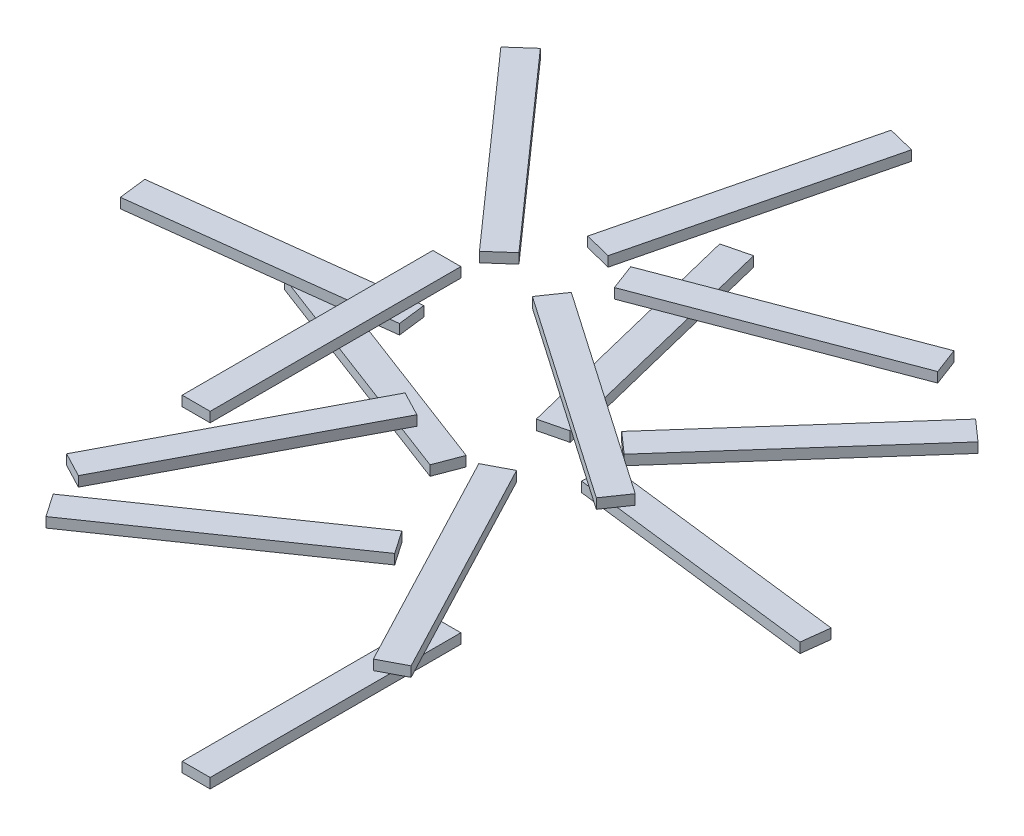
ISO-10303-21;
HEADER;
FILE_DESCRIPTION(('STEP AP214'),'2;1');
FILE_NAME('part.step','',(''),(''),'','','');
FILE_SCHEMA(('AUTOMOTIVE_DESIGN { 1 0 10303 214 1 1 1 1 }'));
ENDSEC;
DATA;
#1=APPLICATION_CONTEXT('core data for automotive mechanical design processes');
#2=APPLICATION_PROTOCOL_DEFINITION('international standard','automotive_design',2000,#1);
#3=PRODUCT_CONTEXT('',#1,'mechanical');
#4=PRODUCT('Part','Part','',(#3));
#5=PRODUCT_RELATED_PRODUCT_CATEGORY('part','',(#4));
#6=PRODUCT_DEFINITION_FORMATION('','',#4);
#7=PRODUCT_DEFINITION_CONTEXT('part definition',#1,'design');
#8=PRODUCT_DEFINITION('design','',#6,#7);
#9=PRODUCT_DEFINITION_SHAPE('','',#8);
#10=(LENGTH_UNIT() NAMED_UNIT(*) SI_UNIT(.MILLI.,.METRE.));
#11=(NAMED_UNIT(*) PLANE_ANGLE_UNIT() SI_UNIT($,.RADIAN.));
#12=(NAMED_UNIT(*) SI_UNIT($,.STERADIAN.) SOLID_ANGLE_UNIT());
#13=UNCERTAINTY_MEASURE_WITH_UNIT(LENGTH_MEASURE(1.E-05),#10,'distance_accuracy_value','');
#14=(GEOMETRIC_REPRESENTATION_CONTEXT(3) GLOBAL_UNCERTAINTY_ASSIGNED_CONTEXT((#13)) GLOBAL_UNIT_ASSIGNED_CONTEXT((#10,
#11,#12)) REPRESENTATION_CONTEXT('',''));
#15=CARTESIAN_POINT('',(0.,0.,0.));
#16=DIRECTION('',(0.,0.,1.));
#17=DIRECTION('',(1.,0.,0.));
#18=AXIS2_PLACEMENT_3D('',#15,#16,#17);
#19=CARTESIAN_POINT('',(179.999999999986,2040.,510.215396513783));
#20=DIRECTION('',(0.,0.,1.));
#21=DIRECTION('',(1.,0.,0.));
#22=AXIS2_PLACEMENT_3D('',#19,#20,#21);
#23=PLANE('',#22);
#24=DIRECTION('',(0.,1.,0.));
#25=VECTOR('',#24,1.);
#26=CARTESIAN_POINT('',(-1.39332989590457E-11,2040.,510.215396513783));
#27=LINE('',#26,#25);
#28=CARTESIAN_POINT('',(-1.39332989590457E-11,1975.67213114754,510.215396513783));
#29=VERTEX_POINT('',#28);
#30=CARTESIAN_POINT('',(-1.39332989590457E-11,2040.,510.215396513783));
#31=VERTEX_POINT('',#30);
#32=EDGE_CURVE('E108',#29,#31,#27,.T.);
#33=ORIENTED_EDGE('',*,*,#32,.T.);
#34=DIRECTION('',(-1.,0.,0.));
#35=VECTOR('',#34,1.);
#36=CARTESIAN_POINT('',(179.999999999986,2040.,510.215396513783));
#37=LINE('',#36,#35);
#38=CARTESIAN_POINT('',(179.999999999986,2040.,510.215396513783));
#39=VERTEX_POINT('',#38);
#40=EDGE_CURVE('E12',#39,#31,#37,.T.);
#41=ORIENTED_EDGE('',*,*,#40,.F.);
#42=DIRECTION('',(0.,1.,0.));
#43=VECTOR('',#42,1.);
#44=CARTESIAN_POINT('',(179.999999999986,2040.,510.215396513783));
#45=LINE('',#44,#43);
#46=CARTESIAN_POINT('',(179.999999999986,1975.67213114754,510.215396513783));
#47=VERTEX_POINT('',#46);
#48=EDGE_CURVE('E96',#47,#39,#45,.T.);
#49=ORIENTED_EDGE('',*,*,#48,.F.);
#50=DIRECTION('',(-1.,0.,0.));
#51=VECTOR('',#50,1.);
#52=CARTESIAN_POINT('',(179.999999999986,1975.67213114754,510.215396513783));
#53=LINE('',#52,#51);
#54=EDGE_CURVE('E104',#47,#29,#53,.T.);
#55=ORIENTED_EDGE('',*,*,#54,.T.);
#56=EDGE_LOOP('',(#33,#41,#49,#55));
#57=FACE_BOUND('',#56,.T.);
#58=ADVANCED_FACE('F45',(#57),#23,.F.);
#59=CARTESIAN_POINT('',(179.999999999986,2040.,510.215396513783));
#60=DIRECTION('',(0.,-1.,0.));
#61=DIRECTION('',(0.,0.,-1.));
#62=AXIS2_PLACEMENT_3D('',#59,#60,#61);
#63=PLANE('',#62);
#64=DIRECTION('',(0.,0.,1.));
#65=VECTOR('',#64,1.);
#66=CARTESIAN_POINT('',(-1.39332989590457E-11,2040.,510.215396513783));
#67=LINE('',#66,#65);
#68=CARTESIAN_POINT('',(-1.39332989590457E-11,2040.,2122.92647757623));
#69=VERTEX_POINT('',#68);
#70=EDGE_CURVE('E100',#31,#69,#67,.T.);
#71=ORIENTED_EDGE('',*,*,#70,.T.);
#72=DIRECTION('',(-1.,0.,0.));
#73=VECTOR('',#72,1.);
#74=CARTESIAN_POINT('',(179.999999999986,2040.,2122.92647757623));
#75=LINE('',#74,#73);
#76=CARTESIAN_POINT('',(179.999999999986,2040.,2122.92647757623));
#77=VERTEX_POINT('',#76);
#78=EDGE_CURVE('E53',#77,#69,#75,.T.);
#79=ORIENTED_EDGE('',*,*,#78,.F.);
#80=DIRECTION('',(0.,0.,1.));
#81=VECTOR('',#80,1.);
#82=CARTESIAN_POINT('',(179.999999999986,2040.,510.215396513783));
#83=LINE('',#82,#81);
#84=EDGE_CURVE('E91',#39,#77,#83,.T.);
#85=ORIENTED_EDGE('',*,*,#84,.F.);
#86=ORIENTED_EDGE('',*,*,#40,.T.);
#87=EDGE_LOOP('',(#71,#79,#85,#86));
#88=FACE_BOUND('',#87,.T.);
#89=ADVANCED_FACE('F99',(#88),#63,.F.);
#90=CARTESIAN_POINT('',(179.999999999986,2040.,2122.92647757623));
#91=DIRECTION('',(0.,0.,-1.));
#92=DIRECTION('',(-1.,0.,0.));
#93=AXIS2_PLACEMENT_3D('',#90,#91,#92);
#94=PLANE('',#93);
#95=DIRECTION('',(0.,-1.,0.));
#96=VECTOR('',#95,1.);
#97=CARTESIAN_POINT('',(-1.39332989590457E-11,2040.,2122.92647757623));
#98=LINE('',#97,#96);
#99=CARTESIAN_POINT('',(-1.39332989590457E-11,1975.67213114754,2122.92647757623));
#100=VERTEX_POINT('',#99);
#101=EDGE_CURVE('E78',#69,#100,#98,.T.);
#102=ORIENTED_EDGE('',*,*,#101,.T.);
#103=DIRECTION('',(-1.,0.,0.));
#104=VECTOR('',#103,1.);
#105=CARTESIAN_POINT('',(179.999999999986,1975.67213114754,2122.92647757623));
#106=LINE('',#105,#104);
#107=CARTESIAN_POINT('',(179.999999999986,1975.67213114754,2122.92647757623));
#108=VERTEX_POINT('',#107);
#109=EDGE_CURVE('E101',#108,#100,#106,.T.);
#110=ORIENTED_EDGE('',*,*,#109,.F.);
#111=DIRECTION('',(0.,-1.,0.));
#112=VECTOR('',#111,1.);
#113=CARTESIAN_POINT('',(179.999999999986,2040.,2122.92647757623));
#114=LINE('',#113,#112);
#115=EDGE_CURVE('E94',#77,#108,#114,.T.);
#116=ORIENTED_EDGE('',*,*,#115,.F.);
#117=ORIENTED_EDGE('',*,*,#78,.T.);
#118=EDGE_LOOP('',(#102,#110,#116,#117));
#119=FACE_BOUND('',#118,.T.);
#120=ADVANCED_FACE('F102',(#119),#94,.F.);
#121=CARTESIAN_POINT('',(179.999999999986,1975.67213114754,510.215396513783));
#122=DIRECTION('',(0.,1.,0.));
#123=DIRECTION('',(0.,0.,1.));
#124=AXIS2_PLACEMENT_3D('',#121,#122,#123);
#125=PLANE('',#124);
#126=DIRECTION('',(0.,0.,-1.));
#127=VECTOR('',#126,1.);
#128=CARTESIAN_POINT('',(-1.39332989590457E-11,1975.67213114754,510.215396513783));
#129=LINE('',#128,#127);
#130=EDGE_CURVE('E84',#100,#29,#129,.T.);
#131=ORIENTED_EDGE('',*,*,#130,.T.);
#132=ORIENTED_EDGE('',*,*,#54,.F.);
#133=DIRECTION('',(0.,0.,-1.));
#134=VECTOR('',#133,1.);
#135=CARTESIAN_POINT('',(179.999999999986,1975.67213114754,510.215396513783));
#136=LINE('',#135,#134);
#137=EDGE_CURVE('E61',#108,#47,#136,.T.);
#138=ORIENTED_EDGE('',*,*,#137,.F.);
#139=ORIENTED_EDGE('',*,*,#109,.T.);
#140=EDGE_LOOP('',(#131,#132,#138,#139));
#141=FACE_BOUND('',#140,.T.);
#142=ADVANCED_FACE('F115',(#141),#125,.F.);
#143=CARTESIAN_POINT('',(179.999999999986,1975.67213114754,510.215396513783));
#144=DIRECTION('',(-1.,0.,0.));
#145=DIRECTION('',(0.,0.,1.));
#146=AXIS2_PLACEMENT_3D('',#143,#144,#145);
#147=PLANE('',#146);
#148=ORIENTED_EDGE('',*,*,#48,.T.);
#149=ORIENTED_EDGE('',*,*,#84,.T.);
#150=ORIENTED_EDGE('',*,*,#115,.T.);
#151=ORIENTED_EDGE('',*,*,#137,.T.);
#152=EDGE_LOOP('',(#148,#149,#150,#151));
#153=FACE_BOUND('',#152,.T.);
#154=ADVANCED_FACE('F92',(#153),#147,.F.);
#155=CARTESIAN_POINT('',(-1.39332989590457E-11,1975.67213114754,510.215396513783));
#156=DIRECTION('',(-1.,0.,0.));
#157=DIRECTION('',(0.,0.,1.));
#158=AXIS2_PLACEMENT_3D('',#155,#156,#157);
#159=PLANE('',#158);
#160=ORIENTED_EDGE('',*,*,#32,.F.);
#161=ORIENTED_EDGE('',*,*,#130,.F.);
#162=ORIENTED_EDGE('',*,*,#101,.F.);
#163=ORIENTED_EDGE('',*,*,#70,.F.);
#164=EDGE_LOOP('',(#160,#161,#162,#163));
#165=FACE_BOUND('',#164,.T.);
#166=ADVANCED_FACE('F118',(#165),#159,.T.);
#167=CLOSED_SHELL('',(#58,#89,#120,#142,#154,#166));
#168=MANIFOLD_SOLID_BREP('B2',#167);
#169=CARTESIAN_POINT('',(522.150791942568,1883.07680964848,141.697922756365));
#170=DIRECTION('',(0.822984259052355,0.,0.568064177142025));
#171=DIRECTION('',(0.568064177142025,-6.6017384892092E-09,-0.822984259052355));
#172=AXIS2_PLACEMENT_3D('',#169,#170,#171);
#173=PLANE('',#172);
#174=DIRECTION('',(3.75020915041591E-09,1.,-5.43312823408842E-09));
#175=VECTOR('',#174,1.);
#176=CARTESIAN_POINT('',(419.899240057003,1883.07681083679,289.835089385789));
#177=LINE('',#176,#175);
#178=CARTESIAN_POINT('',(419.89923981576,1818.74894198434,289.83508973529));
#179=VERTEX_POINT('',#178);
#180=CARTESIAN_POINT('',(419.899240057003,1883.07681083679,289.835089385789));
#181=VERTEX_POINT('',#180);
#182=EDGE_CURVE('E241',#179,#181,#177,.T.);
#183=ORIENTED_EDGE('',*,*,#182,.T.);
#184=DIRECTION('',(-0.568064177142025,6.60173848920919E-09,0.822984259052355));
#185=VECTOR('',#184,1.);
#186=CARTESIAN_POINT('',(522.150791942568,1883.07680964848,141.697922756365));
#187=LINE('',#186,#185);
#188=CARTESIAN_POINT('',(522.150791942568,1883.07680964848,141.697922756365));
#189=VERTEX_POINT('',#188);
#190=EDGE_CURVE('E43',#189,#181,#187,.T.);
#191=ORIENTED_EDGE('',*,*,#190,.F.);
#192=DIRECTION('',(3.75020915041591E-09,1.,-5.43312823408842E-09));
#193=VECTOR('',#192,1.);
#194=CARTESIAN_POINT('',(522.150791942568,1883.07680964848,141.697922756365));
#195=LINE('',#194,#193);
#196=CARTESIAN_POINT('',(522.150791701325,1818.74894079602,141.697923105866));
#197=VERTEX_POINT('',#196);
#198=EDGE_CURVE('E229',#197,#189,#195,.T.);
#199=ORIENTED_EDGE('',*,*,#198,.F.);
#200=DIRECTION('',(-0.568064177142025,6.60173848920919E-09,0.822984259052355));
#201=VECTOR('',#200,1.);
#202=CARTESIAN_POINT('',(522.150791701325,1818.74894079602,141.697923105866));
#203=LINE('',#202,#201);
#204=EDGE_CURVE('E237',#197,#179,#203,.T.);
#205=ORIENTED_EDGE('',*,*,#204,.T.);
#206=EDGE_LOOP('',(#183,#191,#199,#205));
#207=FACE_BOUND('',#206,.T.);
#208=ADVANCED_FACE('F178',(#207),#173,.F.);
#209=CARTESIAN_POINT('',(522.150791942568,1883.07680964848,141.697922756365));
#210=DIRECTION('',(-3.75020915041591E-09,-1.,5.43312823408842E-09));
#211=DIRECTION('',(-0.822984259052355,0.,-0.568064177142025));
#212=AXIS2_PLACEMENT_3D('',#209,#210,#211);
#213=PLANE('',#212);
#214=DIRECTION('',(0.822984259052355,0.,0.568064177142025));
#215=VECTOR('',#214,1.);
#216=CARTESIAN_POINT('',(419.899240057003,1883.07681083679,289.835089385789));
#217=LINE('',#216,#215);
#218=CARTESIAN_POINT('',(1747.1350741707,1883.0768108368,1205.95848261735));
#219=VERTEX_POINT('',#218);
#220=EDGE_CURVE('E233',#181,#219,#217,.T.);
#221=ORIENTED_EDGE('',*,*,#220,.T.);
#222=DIRECTION('',(-0.568064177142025,6.60173848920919E-09,0.822984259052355));
#223=VECTOR('',#222,1.);
#224=CARTESIAN_POINT('',(1849.38662605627,1883.07680964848,1057.82131598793));
#225=LINE('',#224,#223);
#226=CARTESIAN_POINT('',(1849.38662605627,1883.07680964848,1057.82131598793));
#227=VERTEX_POINT('',#226);
#228=EDGE_CURVE('E186',#227,#219,#225,.T.);
#229=ORIENTED_EDGE('',*,*,#228,.F.);
#230=DIRECTION('',(0.822984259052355,0.,0.568064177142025));
#231=VECTOR('',#230,1.);
#232=CARTESIAN_POINT('',(522.150791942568,1883.07680964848,141.697922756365));
#233=LINE('',#232,#231);
#234=EDGE_CURVE('E224',#189,#227,#233,.T.);
#235=ORIENTED_EDGE('',*,*,#234,.F.);
#236=ORIENTED_EDGE('',*,*,#190,.T.);
#237=EDGE_LOOP('',(#221,#229,#235,#236));
#238=FACE_BOUND('',#237,.T.);
#239=ADVANCED_FACE('F232',(#238),#213,.F.);
#240=CARTESIAN_POINT('',(1849.38662605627,1883.07680964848,1057.82131598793));
#241=DIRECTION('',(-0.822984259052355,0.,-0.568064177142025));
#242=DIRECTION('',(-0.568064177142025,6.6017384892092E-09,0.822984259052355));
#243=AXIS2_PLACEMENT_3D('',#240,#241,#242);
#244=PLANE('',#243);
#245=DIRECTION('',(-3.75020915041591E-09,-1.,5.43312823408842E-09));
#246=VECTOR('',#245,1.);
#247=CARTESIAN_POINT('',(1747.1350741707,1883.0768108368,1205.95848261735));
#248=LINE('',#247,#246);
#249=CARTESIAN_POINT('',(1747.13507392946,1818.74894198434,1205.95848296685));
#250=VERTEX_POINT('',#249);
#251=EDGE_CURVE('E211',#219,#250,#248,.T.);
#252=ORIENTED_EDGE('',*,*,#251,.T.);
#253=DIRECTION('',(-0.568064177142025,6.60173848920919E-09,0.822984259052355));
#254=VECTOR('',#253,1.);
#255=CARTESIAN_POINT('',(1849.38662581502,1818.74894079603,1057.82131633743));
#256=LINE('',#255,#254);
#257=CARTESIAN_POINT('',(1849.38662581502,1818.74894079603,1057.82131633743));
#258=VERTEX_POINT('',#257);
#259=EDGE_CURVE('E234',#258,#250,#256,.T.);
#260=ORIENTED_EDGE('',*,*,#259,.F.);
#261=DIRECTION('',(-3.75020915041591E-09,-1.,5.43312823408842E-09));
#262=VECTOR('',#261,1.);
#263=CARTESIAN_POINT('',(1849.38662605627,1883.07680964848,1057.82131598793));
#264=LINE('',#263,#262);
#265=EDGE_CURVE('E227',#227,#258,#264,.T.);
#266=ORIENTED_EDGE('',*,*,#265,.F.);
#267=ORIENTED_EDGE('',*,*,#228,.T.);
#268=EDGE_LOOP('',(#252,#260,#266,#267));
#269=FACE_BOUND('',#268,.T.);
#270=ADVANCED_FACE('F235',(#269),#244,.F.);
#271=CARTESIAN_POINT('',(522.150791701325,1818.74894079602,141.697923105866));
#272=DIRECTION('',(3.75020915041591E-09,1.,-5.43312823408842E-09));
#273=DIRECTION('',(0.822984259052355,0.,0.568064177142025));
#274=AXIS2_PLACEMENT_3D('',#271,#272,#273);
#275=PLANE('',#274);
#276=DIRECTION('',(-0.822984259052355,0.,-0.568064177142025));
#277=VECTOR('',#276,1.);
#278=CARTESIAN_POINT('',(419.89923981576,1818.74894198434,289.83508973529));
#279=LINE('',#278,#277);
#280=EDGE_CURVE('E217',#250,#179,#279,.T.);
#281=ORIENTED_EDGE('',*,*,#280,.T.);
#282=ORIENTED_EDGE('',*,*,#204,.F.);
#283=DIRECTION('',(-0.822984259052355,0.,-0.568064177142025));
#284=VECTOR('',#283,1.);
#285=CARTESIAN_POINT('',(522.150791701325,1818.74894079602,141.697923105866));
#286=LINE('',#285,#284);
#287=EDGE_CURVE('E194',#258,#197,#286,.T.);
#288=ORIENTED_EDGE('',*,*,#287,.F.);
#289=ORIENTED_EDGE('',*,*,#259,.T.);
#290=EDGE_LOOP('',(#281,#282,#288,#289));
#291=FACE_BOUND('',#290,.T.);
#292=ADVANCED_FACE('F248',(#291),#275,.F.);
#293=CARTESIAN_POINT('',(522.150791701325,1818.74894079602,141.697923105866));
#294=DIRECTION('',(-0.568064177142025,6.6017384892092E-09,0.822984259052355));
#295=DIRECTION('',(0.822984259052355,0.,0.568064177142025));
#296=AXIS2_PLACEMENT_3D('',#293,#294,#295);
#297=PLANE('',#296);
#298=ORIENTED_EDGE('',*,*,#198,.T.);
#299=ORIENTED_EDGE('',*,*,#234,.T.);
#300=ORIENTED_EDGE('',*,*,#265,.T.);
#301=ORIENTED_EDGE('',*,*,#287,.T.);
#302=EDGE_LOOP('',(#298,#299,#300,#301));
#303=FACE_BOUND('',#302,.T.);
#304=ADVANCED_FACE('F225',(#303),#297,.F.);
#305=CARTESIAN_POINT('',(419.89923981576,1818.74894198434,289.83508973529));
#306=DIRECTION('',(-0.568064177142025,6.6017384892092E-09,0.822984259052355));
#307=DIRECTION('',(0.822984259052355,0.,0.568064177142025));
#308=AXIS2_PLACEMENT_3D('',#305,#306,#307);
#309=PLANE('',#308);
#310=ORIENTED_EDGE('',*,*,#182,.F.);
#311=ORIENTED_EDGE('',*,*,#280,.F.);
#312=ORIENTED_EDGE('',*,*,#251,.F.);
#313=ORIENTED_EDGE('',*,*,#220,.F.);
#314=EDGE_LOOP('',(#310,#311,#312,#313));
#315=FACE_BOUND('',#314,.T.);
#316=ADVANCED_FACE('F251',(#315),#309,.T.);
#317=CLOSED_SHELL('',(#208,#239,#270,#292,#304,#316));
#318=MANIFOLD_SOLID_BREP('B6',#317);
#319=CARTESIAN_POINT('',(413.23032037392,1726.15362326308,-349.228368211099));
#320=DIRECTION('',(0.93501575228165,0.,-0.354606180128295));
#321=DIRECTION('',(-0.354606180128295,8.83050749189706E-09,-0.93501575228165));
#322=AXIS2_PLACEMENT_3D('',#319,#320,#321);
#323=PLANE('',#322);
#324=DIRECTION('',(3.13135391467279E-09,1.,8.25666308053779E-09));
#325=VECTOR('',#324,1.);
#326=CARTESIAN_POINT('',(477.059432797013,1726.15362167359,-180.925532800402));
#327=LINE('',#326,#325);
#328=CARTESIAN_POINT('',(477.059432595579,1661.82575282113,-180.925533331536));
#329=VERTEX_POINT('',#328);
#330=CARTESIAN_POINT('',(477.059432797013,1726.15362167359,-180.925532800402));
#331=VERTEX_POINT('',#330);
#332=EDGE_CURVE('E374',#329,#331,#327,.T.);
#333=ORIENTED_EDGE('',*,*,#332,.T.);
#334=DIRECTION('',(0.354606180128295,-8.83050749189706E-09,0.93501575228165));
#335=VECTOR('',#334,1.);
#336=CARTESIAN_POINT('',(413.23032037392,1726.15362326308,-349.228368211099));
#337=LINE('',#336,#335);
#338=CARTESIAN_POINT('',(413.23032037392,1726.15362326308,-349.228368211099));
#339=VERTEX_POINT('',#338);
#340=EDGE_CURVE('E176',#339,#331,#337,.T.);
#341=ORIENTED_EDGE('',*,*,#340,.F.);
#342=DIRECTION('',(3.13135391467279E-09,1.,8.25666308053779E-09));
#343=VECTOR('',#342,1.);
#344=CARTESIAN_POINT('',(413.23032037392,1726.15362326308,-349.228368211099));
#345=LINE('',#344,#343);
#346=CARTESIAN_POINT('',(413.230320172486,1661.82575441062,-349.228368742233));
#347=VERTEX_POINT('',#346);
#348=EDGE_CURVE('E362',#347,#339,#345,.T.);
#349=ORIENTED_EDGE('',*,*,#348,.F.);
#350=DIRECTION('',(0.354606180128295,-8.83050749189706E-09,0.93501575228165));
#351=VECTOR('',#350,1.);
#352=CARTESIAN_POINT('',(413.230320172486,1661.82575441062,-349.228368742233));
#353=LINE('',#352,#351);
#354=EDGE_CURVE('E370',#347,#329,#353,.T.);
#355=ORIENTED_EDGE('',*,*,#354,.T.);
#356=EDGE_LOOP('',(#333,#341,#349,#355));
#357=FACE_BOUND('',#356,.T.);
#358=ADVANCED_FACE('F311',(#357),#323,.F.);
#359=CARTESIAN_POINT('',(413.23032037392,1726.15362326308,-349.228368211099));
#360=DIRECTION('',(-3.13135391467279E-09,-1.,-8.25666308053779E-09));
#361=DIRECTION('',(-0.93501575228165,0.,0.354606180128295));
#362=AXIS2_PLACEMENT_3D('',#359,#360,#361);
#363=PLANE('',#362);
#364=DIRECTION('',(0.93501575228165,0.,-0.354606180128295));
#365=VECTOR('',#364,1.);
#366=CARTESIAN_POINT('',(477.059432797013,1726.15362167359,-180.925532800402));
#367=LINE('',#366,#365);
#368=CARTESIAN_POINT('',(1984.96969746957,1726.15362167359,-752.802848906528));
#369=VERTEX_POINT('',#368);
#370=EDGE_CURVE('E366',#331,#369,#367,.T.);
#371=ORIENTED_EDGE('',*,*,#370,.T.);
#372=DIRECTION('',(0.354606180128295,-8.83050749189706E-09,0.93501575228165));
#373=VECTOR('',#372,1.);
#374=CARTESIAN_POINT('',(1921.14058504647,1726.15362326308,-921.105684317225));
#375=LINE('',#374,#373);
#376=CARTESIAN_POINT('',(1921.14058504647,1726.15362326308,-921.105684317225));
#377=VERTEX_POINT('',#376);
#378=EDGE_CURVE('E319',#377,#369,#375,.T.);
#379=ORIENTED_EDGE('',*,*,#378,.F.);
#380=DIRECTION('',(0.93501575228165,0.,-0.354606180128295));
#381=VECTOR('',#380,1.);
#382=CARTESIAN_POINT('',(413.23032037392,1726.15362326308,-349.228368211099));
#383=LINE('',#382,#381);
#384=EDGE_CURVE('E357',#339,#377,#383,.T.);
#385=ORIENTED_EDGE('',*,*,#384,.F.);
#386=ORIENTED_EDGE('',*,*,#340,.T.);
#387=EDGE_LOOP('',(#371,#379,#385,#386));
#388=FACE_BOUND('',#387,.T.);
#389=ADVANCED_FACE('F365',(#388),#363,.F.);
#390=CARTESIAN_POINT('',(1921.14058504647,1726.15362326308,-921.105684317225));
#391=DIRECTION('',(-0.93501575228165,0.,0.354606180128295));
#392=DIRECTION('',(0.354606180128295,-8.83050749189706E-09,0.93501575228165));
#393=AXIS2_PLACEMENT_3D('',#390,#391,#392);
#394=PLANE('',#393);
#395=DIRECTION('',(-3.13135391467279E-09,-1.,-8.25666308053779E-09));
#396=VECTOR('',#395,1.);
#397=CARTESIAN_POINT('',(1984.96969746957,1726.15362167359,-752.802848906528));
#398=LINE('',#397,#396);
#399=CARTESIAN_POINT('',(1984.96969726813,1661.82575282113,-752.802849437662));
#400=VERTEX_POINT('',#399);
#401=EDGE_CURVE('E344',#369,#400,#398,.T.);
#402=ORIENTED_EDGE('',*,*,#401,.T.);
#403=DIRECTION('',(0.354606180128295,-8.83050749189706E-09,0.93501575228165));
#404=VECTOR('',#403,1.);
#405=CARTESIAN_POINT('',(1921.14058484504,1661.82575441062,-921.105684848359));
#406=LINE('',#405,#404);
#407=CARTESIAN_POINT('',(1921.14058484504,1661.82575441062,-921.105684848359));
#408=VERTEX_POINT('',#407);
#409=EDGE_CURVE('E367',#408,#400,#406,.T.);
#410=ORIENTED_EDGE('',*,*,#409,.F.);
#411=DIRECTION('',(-3.13135391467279E-09,-1.,-8.25666308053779E-09));
#412=VECTOR('',#411,1.);
#413=CARTESIAN_POINT('',(1921.14058504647,1726.15362326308,-921.105684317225));
#414=LINE('',#413,#412);
#415=EDGE_CURVE('E360',#377,#408,#414,.T.);
#416=ORIENTED_EDGE('',*,*,#415,.F.);
#417=ORIENTED_EDGE('',*,*,#378,.T.);
#418=EDGE_LOOP('',(#402,#410,#416,#417));
#419=FACE_BOUND('',#418,.T.);
#420=ADVANCED_FACE('F368',(#419),#394,.F.);
#421=CARTESIAN_POINT('',(413.230320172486,1661.82575441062,-349.228368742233));
#422=DIRECTION('',(3.13135391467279E-09,1.,8.25666308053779E-09));
#423=DIRECTION('',(0.93501575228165,0.,-0.354606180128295));
#424=AXIS2_PLACEMENT_3D('',#421,#422,#423);
#425=PLANE('',#424);
#426=DIRECTION('',(-0.93501575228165,0.,0.354606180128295));
#427=VECTOR('',#426,1.);
#428=CARTESIAN_POINT('',(477.059432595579,1661.82575282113,-180.925533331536));
#429=LINE('',#428,#427);
#430=EDGE_CURVE('E350',#400,#329,#429,.T.);
#431=ORIENTED_EDGE('',*,*,#430,.T.);
#432=ORIENTED_EDGE('',*,*,#354,.F.);
#433=DIRECTION('',(-0.93501575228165,0.,0.354606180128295));
#434=VECTOR('',#433,1.);
#435=CARTESIAN_POINT('',(413.230320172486,1661.82575441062,-349.228368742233));
#436=LINE('',#435,#434);
#437=EDGE_CURVE('E327',#408,#347,#436,.T.);
#438=ORIENTED_EDGE('',*,*,#437,.F.);
#439=ORIENTED_EDGE('',*,*,#409,.T.);
#440=EDGE_LOOP('',(#431,#432,#438,#439));
#441=FACE_BOUND('',#440,.T.);
#442=ADVANCED_FACE('F381',(#441),#425,.F.);
#443=CARTESIAN_POINT('',(413.230320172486,1661.82575441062,-349.228368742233));
#444=DIRECTION('',(0.354606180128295,-8.83050749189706E-09,0.93501575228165));
#445=DIRECTION('',(0.93501575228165,0.,-0.354606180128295));
#446=AXIS2_PLACEMENT_3D('',#443,#444,#445);
#447=PLANE('',#446);
#448=ORIENTED_EDGE('',*,*,#348,.T.);
#449=ORIENTED_EDGE('',*,*,#384,.T.);
#450=ORIENTED_EDGE('',*,*,#415,.T.);
#451=ORIENTED_EDGE('',*,*,#437,.T.);
#452=EDGE_LOOP('',(#448,#449,#450,#451));
#453=FACE_BOUND('',#452,.T.);
#454=ADVANCED_FACE('F358',(#453),#447,.F.);
#455=CARTESIAN_POINT('',(477.059432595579,1661.82575282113,-180.925533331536));
#456=DIRECTION('',(0.354606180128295,-8.83050749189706E-09,0.93501575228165));
#457=DIRECTION('',(0.93501575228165,0.,-0.354606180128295));
#458=AXIS2_PLACEMENT_3D('',#455,#456,#457);
#459=PLANE('',#458);
#460=ORIENTED_EDGE('',*,*,#332,.F.);
#461=ORIENTED_EDGE('',*,*,#430,.F.);
#462=ORIENTED_EDGE('',*,*,#401,.F.);
#463=ORIENTED_EDGE('',*,*,#370,.F.);
#464=EDGE_LOOP('',(#460,#461,#462,#463));
#465=FACE_BOUND('',#464,.T.);
#466=ADVANCED_FACE('F384',(#465),#459,.T.);
#467=CLOSED_SHELL('',(#358,#389,#420,#442,#454,#466));
#468=MANIFOLD_SOLID_BREP('B37',#467);
#469=CARTESIAN_POINT('',(-52.6664938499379,1569.23091896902,-538.466332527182));
#470=DIRECTION('',(0.239316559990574,0.,-0.970941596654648));
#471=DIRECTION('',(-0.970941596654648,4.70792627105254E-10,-0.239316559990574));
#472=AXIS2_PLACEMENT_3D('',#469,#470,#471);
#473=PLANE('',#472);
#474=DIRECTION('',(4.57113291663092E-10,1.,1.12664474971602E-10));
#475=VECTOR('',#474,1.);
#476=CARTESIAN_POINT('',(122.102993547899,1569.23091888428,-495.389351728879));
#477=LINE('',#476,#475);
#478=CARTESIAN_POINT('',(122.102993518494,1504.90305003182,-495.389351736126));
#479=VERTEX_POINT('',#478);
#480=CARTESIAN_POINT('',(122.102993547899,1569.23091888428,-495.389351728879));
#481=VERTEX_POINT('',#480);
#482=EDGE_CURVE('E507',#479,#481,#477,.T.);
#483=ORIENTED_EDGE('',*,*,#482,.T.);
#484=DIRECTION('',(0.970941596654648,-4.70792627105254E-10,0.239316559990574));
#485=VECTOR('',#484,1.);
#486=CARTESIAN_POINT('',(-52.6664938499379,1569.23091896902,-538.466332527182));
#487=LINE('',#486,#485);
#488=CARTESIAN_POINT('',(-52.6664938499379,1569.23091896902,-538.466332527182));
#489=VERTEX_POINT('',#488);
#490=EDGE_CURVE('E309',#489,#481,#487,.T.);
#491=ORIENTED_EDGE('',*,*,#490,.F.);
#492=DIRECTION('',(4.57113291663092E-10,1.,1.12664474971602E-10));
#493=VECTOR('',#492,1.);
#494=CARTESIAN_POINT('',(-52.6664938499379,1569.23091896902,-538.466332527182));
#495=LINE('',#494,#493);
#496=CARTESIAN_POINT('',(-52.666493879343,1504.90305011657,-538.46633253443));
#497=VERTEX_POINT('',#496);
#498=EDGE_CURVE('E495',#497,#489,#495,.T.);
#499=ORIENTED_EDGE('',*,*,#498,.F.);
#500=DIRECTION('',(0.970941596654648,-4.70792627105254E-10,0.239316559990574));
#501=VECTOR('',#500,1.);
#502=CARTESIAN_POINT('',(-52.666493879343,1504.90305011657,-538.46633253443));
#503=LINE('',#502,#501);
#504=EDGE_CURVE('E503',#497,#479,#503,.T.);
#505=ORIENTED_EDGE('',*,*,#504,.T.);
#506=EDGE_LOOP('',(#483,#491,#499,#505));
#507=FACE_BOUND('',#506,.T.);
#508=ADVANCED_FACE('F444',(#507),#473,.F.);
#509=CARTESIAN_POINT('',(-52.6664938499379,1569.23091896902,-538.466332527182));
#510=DIRECTION('',(-4.57113291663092E-10,-1.,-1.12664474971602E-10));
#511=DIRECTION('',(-0.239316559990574,0.,0.970941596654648));
#512=AXIS2_PLACEMENT_3D('',#509,#510,#511);
#513=PLANE('',#512);
#514=DIRECTION('',(0.239316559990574,0.,-0.970941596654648));
#515=VECTOR('',#514,1.);
#516=CARTESIAN_POINT('',(122.102993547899,1569.23091888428,-495.389351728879));
#517=LINE('',#516,#515);
#518=CARTESIAN_POINT('',(508.051461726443,1569.23091888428,-2061.23762371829));
#519=VERTEX_POINT('',#518);
#520=EDGE_CURVE('E499',#481,#519,#517,.T.);
#521=ORIENTED_EDGE('',*,*,#520,.T.);
#522=DIRECTION('',(0.970941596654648,-4.70792627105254E-10,0.239316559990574));
#523=VECTOR('',#522,1.);
#524=CARTESIAN_POINT('',(333.281974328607,1569.23091896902,-2104.3146045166));
#525=LINE('',#524,#523);
#526=CARTESIAN_POINT('',(333.281974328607,1569.23091896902,-2104.3146045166));
#527=VERTEX_POINT('',#526);
#528=EDGE_CURVE('E452',#527,#519,#525,.T.);
#529=ORIENTED_EDGE('',*,*,#528,.F.);
#530=DIRECTION('',(0.239316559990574,0.,-0.970941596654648));
#531=VECTOR('',#530,1.);
#532=CARTESIAN_POINT('',(-52.6664938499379,1569.23091896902,-538.466332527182));
#533=LINE('',#532,#531);
#534=EDGE_CURVE('E490',#489,#527,#533,.T.);
#535=ORIENTED_EDGE('',*,*,#534,.F.);
#536=ORIENTED_EDGE('',*,*,#490,.T.);
#537=EDGE_LOOP('',(#521,#529,#535,#536));
#538=FACE_BOUND('',#537,.T.);
#539=ADVANCED_FACE('F498',(#538),#513,.F.);
#540=CARTESIAN_POINT('',(333.281974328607,1569.23091896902,-2104.3146045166));
#541=DIRECTION('',(-0.239316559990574,0.,0.970941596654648));
#542=DIRECTION('',(0.970941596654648,-4.70792627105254E-10,0.239316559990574));
#543=AXIS2_PLACEMENT_3D('',#540,#541,#542);
#544=PLANE('',#543);
#545=DIRECTION('',(-4.57113291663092E-10,-1.,-1.12664474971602E-10));
#546=VECTOR('',#545,1.);
#547=CARTESIAN_POINT('',(508.051461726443,1569.23091888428,-2061.23762371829));
#548=LINE('',#547,#546);
#549=CARTESIAN_POINT('',(508.051461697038,1504.90305003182,-2061.23762372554));
#550=VERTEX_POINT('',#549);
#551=EDGE_CURVE('E477',#519,#550,#548,.T.);
#552=ORIENTED_EDGE('',*,*,#551,.T.);
#553=DIRECTION('',(0.970941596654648,-4.70792627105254E-10,0.239316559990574));
#554=VECTOR('',#553,1.);
#555=CARTESIAN_POINT('',(333.281974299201,1504.90305011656,-2104.31460452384));
#556=LINE('',#555,#554);
#557=CARTESIAN_POINT('',(333.281974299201,1504.90305011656,-2104.31460452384));
#558=VERTEX_POINT('',#557);
#559=EDGE_CURVE('E500',#558,#550,#556,.T.);
#560=ORIENTED_EDGE('',*,*,#559,.F.);
#561=DIRECTION('',(-4.57113291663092E-10,-1.,-1.12664474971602E-10));
#562=VECTOR('',#561,1.);
#563=CARTESIAN_POINT('',(333.281974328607,1569.23091896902,-2104.3146045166));
#564=LINE('',#563,#562);
#565=EDGE_CURVE('E493',#527,#558,#564,.T.);
#566=ORIENTED_EDGE('',*,*,#565,.F.);
#567=ORIENTED_EDGE('',*,*,#528,.T.);
#568=EDGE_LOOP('',(#552,#560,#566,#567));
#569=FACE_BOUND('',#568,.T.);
#570=ADVANCED_FACE('F501',(#569),#544,.F.);
#571=CARTESIAN_POINT('',(-52.666493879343,1504.90305011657,-538.46633253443));
#572=DIRECTION('',(4.57113291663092E-10,1.,1.12664474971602E-10));
#573=DIRECTION('',(0.239316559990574,0.,-0.970941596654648));
#574=AXIS2_PLACEMENT_3D('',#571,#572,#573);
#575=PLANE('',#574);
#576=DIRECTION('',(-0.239316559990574,0.,0.970941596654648));
#577=VECTOR('',#576,1.);
#578=CARTESIAN_POINT('',(122.102993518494,1504.90305003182,-495.389351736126));
#579=LINE('',#578,#577);
#580=EDGE_CURVE('E483',#550,#479,#579,.T.);
#581=ORIENTED_EDGE('',*,*,#580,.T.);
#582=ORIENTED_EDGE('',*,*,#504,.F.);
#583=DIRECTION('',(-0.239316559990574,0.,0.970941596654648));
#584=VECTOR('',#583,1.);
#585=CARTESIAN_POINT('',(-52.666493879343,1504.90305011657,-538.46633253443));
#586=LINE('',#585,#584);
#587=EDGE_CURVE('E460',#558,#497,#586,.T.);
#588=ORIENTED_EDGE('',*,*,#587,.F.);
#589=ORIENTED_EDGE('',*,*,#559,.T.);
#590=EDGE_LOOP('',(#581,#582,#588,#589));
#591=FACE_BOUND('',#590,.T.);
#592=ADVANCED_FACE('F514',(#591),#575,.F.);
#593=CARTESIAN_POINT('',(-52.666493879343,1504.90305011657,-538.46633253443));
#594=DIRECTION('',(0.970941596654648,-4.70792627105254E-10,0.239316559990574));
#595=DIRECTION('',(0.239316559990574,0.,-0.970941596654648));
#596=AXIS2_PLACEMENT_3D('',#593,#594,#595);
#597=PLANE('',#596);
#598=ORIENTED_EDGE('',*,*,#498,.T.);
#599=ORIENTED_EDGE('',*,*,#534,.T.);
#600=ORIENTED_EDGE('',*,*,#565,.T.);
#601=ORIENTED_EDGE('',*,*,#587,.T.);
#602=EDGE_LOOP('',(#598,#599,#600,#601));
#603=FACE_BOUND('',#602,.T.);
#604=ADVANCED_FACE('F491',(#603),#597,.F.);
#605=CARTESIAN_POINT('',(122.102993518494,1504.90305003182,-495.389351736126));
#606=DIRECTION('',(0.970941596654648,-4.70792627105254E-10,0.239316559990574));
#607=DIRECTION('',(0.239316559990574,0.,-0.970941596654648));
#608=AXIS2_PLACEMENT_3D('',#605,#606,#607);
#609=PLANE('',#608);
#610=ORIENTED_EDGE('',*,*,#482,.F.);
#611=ORIENTED_EDGE('',*,*,#580,.F.);
#612=ORIENTED_EDGE('',*,*,#551,.F.);
#613=ORIENTED_EDGE('',*,*,#520,.F.);
#614=EDGE_LOOP('',(#610,#611,#612,#613));
#615=FACE_BOUND('',#614,.T.);
#616=ADVANCED_FACE('F517',(#615),#609,.T.);
#617=CLOSED_SHELL('',(#508,#539,#570,#592,#604,#616));
#618=MANIFOLD_SOLID_BREP('B170',#617);
#619=CARTESIAN_POINT('',(-473.067264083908,1412.30772610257,-262.539738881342));
#620=DIRECTION('',(-0.663122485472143,0.,-0.748510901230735));
#621=DIRECTION('',(-0.748510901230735,-2.0102802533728E-08,0.663122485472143));
#622=AXIS2_PLACEMENT_3D('',#619,#620,#621);
#623=PLANE('',#622);
#624=DIRECTION('',(-1.5047157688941E-08,1.,1.33306307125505E-08));
#625=VECTOR('',#624,1.);
#626=CARTESIAN_POINT('',(-338.335301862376,1412.30772972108,-381.901786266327));
#627=LINE('',#626,#625);
#628=CARTESIAN_POINT('',(-338.335300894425,1347.97986086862,-381.901787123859));
#629=VERTEX_POINT('',#628);
#630=CARTESIAN_POINT('',(-338.335301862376,1412.30772972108,-381.901786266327));
#631=VERTEX_POINT('',#630);
#632=EDGE_CURVE('E640',#629,#631,#627,.T.);
#633=ORIENTED_EDGE('',*,*,#632,.T.);
#634=DIRECTION('',(0.748510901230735,2.0102802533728E-08,-0.663122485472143));
#635=VECTOR('',#634,1.);
#636=CARTESIAN_POINT('',(-473.067264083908,1412.30772610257,-262.539738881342));
#637=LINE('',#636,#635);
#638=CARTESIAN_POINT('',(-473.067264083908,1412.30772610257,-262.539738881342));
#639=VERTEX_POINT('',#638);
#640=EDGE_CURVE('E442',#639,#631,#637,.T.);
#641=ORIENTED_EDGE('',*,*,#640,.F.);
#642=DIRECTION('',(-1.5047157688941E-08,1.,1.33306307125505E-08));
#643=VECTOR('',#642,1.);
#644=CARTESIAN_POINT('',(-473.067264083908,1412.30772610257,-262.539738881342));
#645=LINE('',#644,#643);
#646=CARTESIAN_POINT('',(-473.067263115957,1347.97985725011,-262.539739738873));
#647=VERTEX_POINT('',#646);
#648=EDGE_CURVE('E628',#647,#639,#645,.T.);
#649=ORIENTED_EDGE('',*,*,#648,.F.);
#650=DIRECTION('',(0.748510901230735,2.0102802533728E-08,-0.663122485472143));
#651=VECTOR('',#650,1.);
#652=CARTESIAN_POINT('',(-473.067263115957,1347.97985725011,-262.539739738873));
#653=LINE('',#652,#651);
#654=EDGE_CURVE('E636',#647,#629,#653,.T.);
#655=ORIENTED_EDGE('',*,*,#654,.T.);
#656=EDGE_LOOP('',(#633,#641,#649,#655));
#657=FACE_BOUND('',#656,.T.);
#658=ADVANCED_FACE('F577',(#657),#623,.F.);
#659=CARTESIAN_POINT('',(-473.067264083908,1412.30772610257,-262.539738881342));
#660=DIRECTION('',(1.5047157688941E-08,-1.,-1.33306307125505E-08));
#661=DIRECTION('',(0.663122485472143,0.,0.748510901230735));
#662=AXIS2_PLACEMENT_3D('',#659,#660,#661);
#663=PLANE('',#662);
#664=DIRECTION('',(-0.663122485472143,0.,-0.748510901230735));
#665=VECTOR('',#664,1.);
#666=CARTESIAN_POINT('',(-338.335301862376,1412.30772972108,-381.901786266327));
#667=LINE('',#666,#665);
#668=CARTESIAN_POINT('',(-1407.76028228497,1412.3077297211,-1589.03361097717));
#669=VERTEX_POINT('',#668);
#670=EDGE_CURVE('E632',#631,#669,#667,.T.);
#671=ORIENTED_EDGE('',*,*,#670,.T.);
#672=DIRECTION('',(0.748510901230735,2.0102802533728E-08,-0.663122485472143));
#673=VECTOR('',#672,1.);
#674=CARTESIAN_POINT('',(-1542.4922445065,1412.30772610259,-1469.67156359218));
#675=LINE('',#674,#673);
#676=CARTESIAN_POINT('',(-1542.4922445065,1412.30772610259,-1469.67156359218));
#677=VERTEX_POINT('',#676);
#678=EDGE_CURVE('E585',#677,#669,#675,.T.);
#679=ORIENTED_EDGE('',*,*,#678,.F.);
#680=DIRECTION('',(-0.663122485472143,0.,-0.748510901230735));
#681=VECTOR('',#680,1.);
#682=CARTESIAN_POINT('',(-473.067264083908,1412.30772610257,-262.539738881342));
#683=LINE('',#682,#681);
#684=EDGE_CURVE('E623',#639,#677,#683,.T.);
#685=ORIENTED_EDGE('',*,*,#684,.F.);
#686=ORIENTED_EDGE('',*,*,#640,.T.);
#687=EDGE_LOOP('',(#671,#679,#685,#686));
#688=FACE_BOUND('',#687,.T.);
#689=ADVANCED_FACE('F631',(#688),#663,.F.);
#690=CARTESIAN_POINT('',(-1542.4922445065,1412.30772610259,-1469.67156359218));
#691=DIRECTION('',(0.663122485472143,0.,0.748510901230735));
#692=DIRECTION('',(0.748510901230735,2.0102802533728E-08,-0.663122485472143));
#693=AXIS2_PLACEMENT_3D('',#690,#691,#692);
#694=PLANE('',#693);
#695=DIRECTION('',(1.5047157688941E-08,-1.,-1.33306307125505E-08));
#696=VECTOR('',#695,1.);
#697=CARTESIAN_POINT('',(-1407.76028228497,1412.3077297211,-1589.03361097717));
#698=LINE('',#697,#696);
#699=CARTESIAN_POINT('',(-1407.76028131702,1347.97986086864,-1589.0336118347));
#700=VERTEX_POINT('',#699);
#701=EDGE_CURVE('E610',#669,#700,#698,.T.);
#702=ORIENTED_EDGE('',*,*,#701,.T.);
#703=DIRECTION('',(0.748510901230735,2.0102802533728E-08,-0.663122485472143));
#704=VECTOR('',#703,1.);
#705=CARTESIAN_POINT('',(-1542.49224353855,1347.97985725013,-1469.67156444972));
#706=LINE('',#705,#704);
#707=CARTESIAN_POINT('',(-1542.49224353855,1347.97985725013,-1469.67156444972));
#708=VERTEX_POINT('',#707);
#709=EDGE_CURVE('E633',#708,#700,#706,.T.);
#710=ORIENTED_EDGE('',*,*,#709,.F.);
#711=DIRECTION('',(1.5047157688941E-08,-1.,-1.33306307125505E-08));
#712=VECTOR('',#711,1.);
#713=CARTESIAN_POINT('',(-1542.4922445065,1412.30772610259,-1469.67156359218));
#714=LINE('',#713,#712);
#715=EDGE_CURVE('E626',#677,#708,#714,.T.);
#716=ORIENTED_EDGE('',*,*,#715,.F.);
#717=ORIENTED_EDGE('',*,*,#678,.T.);
#718=EDGE_LOOP('',(#702,#710,#716,#717));
#719=FACE_BOUND('',#718,.T.);
#720=ADVANCED_FACE('F634',(#719),#694,.F.);
#721=CARTESIAN_POINT('',(-473.067263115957,1347.97985725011,-262.539739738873));
#722=DIRECTION('',(-1.5047157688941E-08,1.,1.33306307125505E-08));
#723=DIRECTION('',(-0.663122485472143,0.,-0.748510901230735));
#724=AXIS2_PLACEMENT_3D('',#721,#722,#723);
#725=PLANE('',#724);
#726=DIRECTION('',(0.663122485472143,0.,0.748510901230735));
#727=VECTOR('',#726,1.);
#728=CARTESIAN_POINT('',(-338.335300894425,1347.97986086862,-381.901787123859));
#729=LINE('',#728,#727);
#730=EDGE_CURVE('E616',#700,#629,#729,.T.);
#731=ORIENTED_EDGE('',*,*,#730,.T.);
#732=ORIENTED_EDGE('',*,*,#654,.F.);
#733=DIRECTION('',(0.663122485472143,0.,0.748510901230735));
#734=VECTOR('',#733,1.);
#735=CARTESIAN_POINT('',(-473.067263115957,1347.97985725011,-262.539739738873));
#736=LINE('',#735,#734);
#737=EDGE_CURVE('E593',#708,#647,#736,.T.);
#738=ORIENTED_EDGE('',*,*,#737,.F.);
#739=ORIENTED_EDGE('',*,*,#709,.T.);
#740=EDGE_LOOP('',(#731,#732,#738,#739));
#741=FACE_BOUND('',#740,.T.);
#742=ADVANCED_FACE('F647',(#741),#725,.F.);
#743=CARTESIAN_POINT('',(-473.067263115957,1347.97985725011,-262.539739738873));
#744=DIRECTION('',(0.748510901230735,2.0102802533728E-08,-0.663122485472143));
#745=DIRECTION('',(-0.663122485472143,0.,-0.748510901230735));
#746=AXIS2_PLACEMENT_3D('',#743,#744,#745);
#747=PLANE('',#746);
#748=ORIENTED_EDGE('',*,*,#648,.T.);
#749=ORIENTED_EDGE('',*,*,#684,.T.);
#750=ORIENTED_EDGE('',*,*,#715,.T.);
#751=ORIENTED_EDGE('',*,*,#737,.T.);
#752=EDGE_LOOP('',(#748,#749,#750,#751));
#753=FACE_BOUND('',#752,.T.);
#754=ADVANCED_FACE('F624',(#753),#747,.F.);
#755=CARTESIAN_POINT('',(-338.335300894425,1347.97986086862,-381.901787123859));
#756=DIRECTION('',(0.748510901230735,2.0102802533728E-08,-0.663122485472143));
#757=DIRECTION('',(-0.663122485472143,0.,-0.748510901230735));
#758=AXIS2_PLACEMENT_3D('',#755,#756,#757);
#759=PLANE('',#758);
#760=ORIENTED_EDGE('',*,*,#632,.F.);
#761=ORIENTED_EDGE('',*,*,#730,.F.);
#762=ORIENTED_EDGE('',*,*,#701,.F.);
#763=ORIENTED_EDGE('',*,*,#670,.F.);
#764=EDGE_LOOP('',(#760,#761,#762,#763));
#765=FACE_BOUND('',#764,.T.);
#766=ADVANCED_FACE('F650',(#765),#759,.T.);
#767=CLOSED_SHELL('',(#658,#689,#720,#742,#754,#766));
#768=MANIFOLD_SOLID_BREP('B303',#767);
#769=CARTESIAN_POINT('',(-484.798638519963,1255.38453803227,240.187491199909));
#770=DIRECTION('',(-0.992708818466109,0.,0.120537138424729));
#771=DIRECTION('',(0.120537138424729,-1.40310812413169E-08,0.992708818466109));
#772=AXIS2_PLACEMENT_3D('',#769,#770,#771);
#773=PLANE('',#772);
#774=DIRECTION('',(1.69128063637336E-09,1.,1.39287762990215E-08));
#775=VECTOR('',#774,1.);
#776=CARTESIAN_POINT('',(-506.495323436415,1255.38454055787,61.4999038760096));
#777=LINE('',#776,#775);
#778=CARTESIAN_POINT('',(-506.495323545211,1191.05667170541,61.4999029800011));
#779=VERTEX_POINT('',#778);
#780=CARTESIAN_POINT('',(-506.495323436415,1255.38454055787,61.4999038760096));
#781=VERTEX_POINT('',#780);
#782=EDGE_CURVE('E773',#779,#781,#777,.T.);
#783=ORIENTED_EDGE('',*,*,#782,.T.);
#784=DIRECTION('',(-0.120537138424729,1.40310812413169E-08,-0.992708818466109));
#785=VECTOR('',#784,1.);
#786=CARTESIAN_POINT('',(-484.798638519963,1255.38453803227,240.187491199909));
#787=LINE('',#786,#785);
#788=CARTESIAN_POINT('',(-484.798638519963,1255.38453803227,240.187491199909));
#789=VERTEX_POINT('',#788);
#790=EDGE_CURVE('E575',#789,#781,#787,.T.);
#791=ORIENTED_EDGE('',*,*,#790,.F.);
#792=DIRECTION('',(1.69128063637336E-09,1.,1.39287762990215E-08));
#793=VECTOR('',#792,1.);
#794=CARTESIAN_POINT('',(-484.798638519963,1255.38453803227,240.187491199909));
#795=LINE('',#794,#793);
#796=CARTESIAN_POINT('',(-484.79863862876,1191.05666917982,240.187490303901));
#797=VERTEX_POINT('',#796);
#798=EDGE_CURVE('E761',#797,#789,#795,.T.);
#799=ORIENTED_EDGE('',*,*,#798,.F.);
#800=DIRECTION('',(-0.120537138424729,1.40310812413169E-08,-0.992708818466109));
#801=VECTOR('',#800,1.);
#802=CARTESIAN_POINT('',(-484.79863862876,1191.05666917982,240.187490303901));
#803=LINE('',#802,#801);
#804=EDGE_CURVE('E769',#797,#779,#803,.T.);
#805=ORIENTED_EDGE('',*,*,#804,.T.);
#806=EDGE_LOOP('',(#783,#791,#799,#805));
#807=FACE_BOUND('',#806,.T.);
#808=ADVANCED_FACE('F710',(#807),#773,.F.);
#809=CARTESIAN_POINT('',(-484.798638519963,1255.38453803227,240.187491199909));
#810=DIRECTION('',(-1.69128063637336E-09,-1.,-1.39287762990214E-08));
#811=DIRECTION('',(0.992708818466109,0.,-0.120537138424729));
#812=AXIS2_PLACEMENT_3D('',#809,#810,#811);
#813=PLANE('',#812);
#814=DIRECTION('',(-0.992708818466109,0.,0.120537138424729));
#815=VECTOR('',#814,1.);
#816=CARTESIAN_POINT('',(-506.495323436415,1255.38454055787,61.4999038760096));
#817=LINE('',#816,#815);
#818=CARTESIAN_POINT('',(-2107.44783524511,1255.38454055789,255.891482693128));
#819=VERTEX_POINT('',#818);
#820=EDGE_CURVE('E765',#781,#819,#817,.T.);
#821=ORIENTED_EDGE('',*,*,#820,.T.);
#822=DIRECTION('',(-0.120537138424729,1.40310812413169E-08,-0.992708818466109));
#823=VECTOR('',#822,1.);
#824=CARTESIAN_POINT('',(-2085.75115032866,1255.3845380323,434.579070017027));
#825=LINE('',#824,#823);
#826=CARTESIAN_POINT('',(-2085.75115032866,1255.3845380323,434.579070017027));
#827=VERTEX_POINT('',#826);
#828=EDGE_CURVE('E718',#827,#819,#825,.T.);
#829=ORIENTED_EDGE('',*,*,#828,.F.);
#830=DIRECTION('',(-0.992708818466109,0.,0.120537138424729));
#831=VECTOR('',#830,1.);
#832=CARTESIAN_POINT('',(-484.798638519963,1255.38453803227,240.187491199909));
#833=LINE('',#832,#831);
#834=EDGE_CURVE('E756',#789,#827,#833,.T.);
#835=ORIENTED_EDGE('',*,*,#834,.F.);
#836=ORIENTED_EDGE('',*,*,#790,.T.);
#837=EDGE_LOOP('',(#821,#829,#835,#836));
#838=FACE_BOUND('',#837,.T.);
#839=ADVANCED_FACE('F764',(#838),#813,.F.);
#840=CARTESIAN_POINT('',(-2085.75115032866,1255.3845380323,434.579070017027));
#841=DIRECTION('',(0.992708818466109,0.,-0.120537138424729));
#842=DIRECTION('',(-0.120537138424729,1.40310812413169E-08,-0.992708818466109));
#843=AXIS2_PLACEMENT_3D('',#840,#841,#842);
#844=PLANE('',#843);
#845=DIRECTION('',(-1.69128063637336E-09,-1.,-1.39287762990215E-08));
#846=VECTOR('',#845,1.);
#847=CARTESIAN_POINT('',(-2107.44783524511,1255.38454055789,255.891482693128));
#848=LINE('',#847,#846);
#849=CARTESIAN_POINT('',(-2107.44783535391,1191.05667170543,255.891481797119));
#850=VERTEX_POINT('',#849);
#851=EDGE_CURVE('E743',#819,#850,#848,.T.);
#852=ORIENTED_EDGE('',*,*,#851,.T.);
#853=DIRECTION('',(-0.120537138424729,1.40310812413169E-08,-0.992708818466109));
#854=VECTOR('',#853,1.);
#855=CARTESIAN_POINT('',(-2085.75115043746,1191.05666917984,434.579069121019));
#856=LINE('',#855,#854);
#857=CARTESIAN_POINT('',(-2085.75115043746,1191.05666917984,434.579069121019));
#858=VERTEX_POINT('',#857);
#859=EDGE_CURVE('E766',#858,#850,#856,.T.);
#860=ORIENTED_EDGE('',*,*,#859,.F.);
#861=DIRECTION('',(-1.69128063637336E-09,-1.,-1.39287762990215E-08));
#862=VECTOR('',#861,1.);
#863=CARTESIAN_POINT('',(-2085.75115032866,1255.3845380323,434.579070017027));
#864=LINE('',#863,#862);
#865=EDGE_CURVE('E759',#827,#858,#864,.T.);
#866=ORIENTED_EDGE('',*,*,#865,.F.);
#867=ORIENTED_EDGE('',*,*,#828,.T.);
#868=EDGE_LOOP('',(#852,#860,#866,#867));
#869=FACE_BOUND('',#868,.T.);
#870=ADVANCED_FACE('F767',(#869),#844,.F.);
#871=CARTESIAN_POINT('',(-484.79863862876,1191.05666917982,240.187490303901));
#872=DIRECTION('',(1.69128063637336E-09,1.,1.39287762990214E-08));
#873=DIRECTION('',(-0.992708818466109,0.,0.120537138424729));
#874=AXIS2_PLACEMENT_3D('',#871,#872,#873);
#875=PLANE('',#874);
#876=DIRECTION('',(0.992708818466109,0.,-0.120537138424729));
#877=VECTOR('',#876,1.);
#878=CARTESIAN_POINT('',(-506.495323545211,1191.05667170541,61.4999029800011));
#879=LINE('',#878,#877);
#880=EDGE_CURVE('E749',#850,#779,#879,.T.);
#881=ORIENTED_EDGE('',*,*,#880,.T.);
#882=ORIENTED_EDGE('',*,*,#804,.F.);
#883=DIRECTION('',(0.992708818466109,0.,-0.120537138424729));
#884=VECTOR('',#883,1.);
#885=CARTESIAN_POINT('',(-484.79863862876,1191.05666917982,240.187490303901));
#886=LINE('',#885,#884);
#887=EDGE_CURVE('E726',#858,#797,#886,.T.);
#888=ORIENTED_EDGE('',*,*,#887,.F.);
#889=ORIENTED_EDGE('',*,*,#859,.T.);
#890=EDGE_LOOP('',(#881,#882,#888,#889));
#891=FACE_BOUND('',#890,.T.);
#892=ADVANCED_FACE('F780',(#891),#875,.F.);
#893=CARTESIAN_POINT('',(-484.79863862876,1191.05666917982,240.187490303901));
#894=DIRECTION('',(-0.120537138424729,1.40310812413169E-08,-0.992708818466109));
#895=DIRECTION('',(-0.992708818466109,0.,0.120537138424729));
#896=AXIS2_PLACEMENT_3D('',#893,#894,#895);
#897=PLANE('',#896);
#898=ORIENTED_EDGE('',*,*,#798,.T.);
#899=ORIENTED_EDGE('',*,*,#834,.T.);
#900=ORIENTED_EDGE('',*,*,#865,.T.);
#901=ORIENTED_EDGE('',*,*,#887,.T.);
#902=EDGE_LOOP('',(#898,#899,#900,#901));
#903=FACE_BOUND('',#902,.T.);
#904=ADVANCED_FACE('F757',(#903),#897,.F.);
#905=CARTESIAN_POINT('',(-506.495323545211,1191.05667170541,61.4999029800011));
#906=DIRECTION('',(-0.120537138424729,1.40310812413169E-08,-0.992708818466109));
#907=DIRECTION('',(-0.992708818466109,0.,0.120537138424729));
#908=AXIS2_PLACEMENT_3D('',#905,#906,#907);
#909=PLANE('',#908);
#910=ORIENTED_EDGE('',*,*,#782,.F.);
#911=ORIENTED_EDGE('',*,*,#880,.F.);
#912=ORIENTED_EDGE('',*,*,#851,.F.);
#913=ORIENTED_EDGE('',*,*,#820,.F.);
#914=EDGE_LOOP('',(#910,#911,#912,#913));
#915=FACE_BOUND('',#914,.T.);
#916=ADVANCED_FACE('F783',(#915),#909,.T.);
#917=CLOSED_SHELL('',(#808,#839,#870,#892,#904,#916));
#918=MANIFOLD_SOLID_BREP('B436',#917);
#919=CARTESIAN_POINT('',(-77.72781980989,1098.46183883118,535.423324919));
#920=DIRECTION('',(-0.464724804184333,0.,0.885455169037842));
#921=DIRECTION('',(0.885455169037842,5.90341029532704E-09,0.464724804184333));
#922=AXIS2_PLACEMENT_3D('',#919,#920,#921);
#923=PLANE('',#922);
#924=DIRECTION('',(-5.22719878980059E-09,1.,-2.74347333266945E-09));
#925=VECTOR('',#924,1.);
#926=CARTESIAN_POINT('',(-237.109750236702,1098.46183776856,451.77286016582));
#927=LINE('',#926,#925);
#928=CARTESIAN_POINT('',(-237.109749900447,1034.1339689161,451.772860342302));
#929=VERTEX_POINT('',#928);
#930=CARTESIAN_POINT('',(-237.109750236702,1098.46183776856,451.77286016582));
#931=VERTEX_POINT('',#930);
#932=EDGE_CURVE('E906',#929,#931,#927,.T.);
#933=ORIENTED_EDGE('',*,*,#932,.T.);
#934=DIRECTION('',(-0.885455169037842,-5.90341029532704E-09,-0.464724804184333));
#935=VECTOR('',#934,1.);
#936=CARTESIAN_POINT('',(-77.72781980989,1098.46183883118,535.423324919));
#937=LINE('',#936,#935);
#938=CARTESIAN_POINT('',(-77.72781980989,1098.46183883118,535.423324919));
#939=VERTEX_POINT('',#938);
#940=EDGE_CURVE('E708',#939,#931,#937,.T.);
#941=ORIENTED_EDGE('',*,*,#940,.F.);
#942=DIRECTION('',(-5.22719878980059E-09,1.,-2.74347333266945E-09));
#943=VECTOR('',#942,1.);
#944=CARTESIAN_POINT('',(-77.72781980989,1098.46183883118,535.423324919));
#945=LINE('',#944,#943);
#946=CARTESIAN_POINT('',(-77.7278194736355,1034.13396997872,535.423325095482));
#947=VERTEX_POINT('',#946);
#948=EDGE_CURVE('E894',#947,#939,#945,.T.);
#949=ORIENTED_EDGE('',*,*,#948,.F.);
#950=DIRECTION('',(-0.885455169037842,-5.90341029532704E-09,-0.464724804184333));
#951=VECTOR('',#950,1.);
#952=CARTESIAN_POINT('',(-77.7278194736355,1034.13396997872,535.423325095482));
#953=LINE('',#952,#951);
#954=EDGE_CURVE('E902',#947,#929,#953,.T.);
#955=ORIENTED_EDGE('',*,*,#954,.T.);
#956=EDGE_LOOP('',(#933,#941,#949,#955));
#957=FACE_BOUND('',#956,.T.);
#958=ADVANCED_FACE('F843',(#957),#923,.F.);
#959=CARTESIAN_POINT('',(-77.72781980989,1098.46183883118,535.423324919));
#960=DIRECTION('',(5.22719878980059E-09,-1.,2.74347333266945E-09));
#961=DIRECTION('',(0.464724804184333,0.,-0.885455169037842));
#962=AXIS2_PLACEMENT_3D('',#959,#960,#961);
#963=PLANE('',#962);
#964=DIRECTION('',(-0.464724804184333,0.,0.885455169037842));
#965=VECTOR('',#964,1.);
#966=CARTESIAN_POINT('',(-237.109750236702,1098.46183776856,451.77286016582));
#967=LINE('',#966,#965);
#968=CARTESIAN_POINT('',(-986.57659158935,1098.46183776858,1879.75622305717));
#969=VERTEX_POINT('',#968);
#970=EDGE_CURVE('E898',#931,#969,#967,.T.);
#971=ORIENTED_EDGE('',*,*,#970,.T.);
#972=DIRECTION('',(-0.885455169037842,-5.90341029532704E-09,-0.464724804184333));
#973=VECTOR('',#972,1.);
#974=CARTESIAN_POINT('',(-827.194661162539,1098.4618388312,1963.40668781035));
#975=LINE('',#974,#973);
#976=CARTESIAN_POINT('',(-827.194661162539,1098.4618388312,1963.40668781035));
#977=VERTEX_POINT('',#976);
#978=EDGE_CURVE('E851',#977,#969,#975,.T.);
#979=ORIENTED_EDGE('',*,*,#978,.F.);
#980=DIRECTION('',(-0.464724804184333,0.,0.885455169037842));
#981=VECTOR('',#980,1.);
#982=CARTESIAN_POINT('',(-77.72781980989,1098.46183883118,535.423324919));
#983=LINE('',#982,#981);
#984=EDGE_CURVE('E889',#939,#977,#983,.T.);
#985=ORIENTED_EDGE('',*,*,#984,.F.);
#986=ORIENTED_EDGE('',*,*,#940,.T.);
#987=EDGE_LOOP('',(#971,#979,#985,#986));
#988=FACE_BOUND('',#987,.T.);
#989=ADVANCED_FACE('F897',(#988),#963,.F.);
#990=CARTESIAN_POINT('',(-827.194661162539,1098.4618388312,1963.40668781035));
#991=DIRECTION('',(0.464724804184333,0.,-0.885455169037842));
#992=DIRECTION('',(-0.885455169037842,-5.90341029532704E-09,-0.464724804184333));
#993=AXIS2_PLACEMENT_3D('',#990,#991,#992);
#994=PLANE('',#993);
#995=DIRECTION('',(5.22719878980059E-09,-1.,2.74347333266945E-09));
#996=VECTOR('',#995,1.);
#997=CARTESIAN_POINT('',(-986.57659158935,1098.46183776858,1879.75622305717));
#998=LINE('',#997,#996);
#999=CARTESIAN_POINT('',(-986.576591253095,1034.13396891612,1879.75622323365));
#1000=VERTEX_POINT('',#999);
#1001=EDGE_CURVE('E876',#969,#1000,#998,.T.);
#1002=ORIENTED_EDGE('',*,*,#1001,.T.);
#1003=DIRECTION('',(-0.885455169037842,-5.90341029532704E-09,-0.464724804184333));
#1004=VECTOR('',#1003,1.);
#1005=CARTESIAN_POINT('',(-827.194660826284,1034.13396997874,1963.40668798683));
#1006=LINE('',#1005,#1004);
#1007=CARTESIAN_POINT('',(-827.194660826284,1034.13396997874,1963.40668798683));
#1008=VERTEX_POINT('',#1007);
#1009=EDGE_CURVE('E899',#1008,#1000,#1006,.T.);
#1010=ORIENTED_EDGE('',*,*,#1009,.F.);
#1011=DIRECTION('',(5.22719878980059E-09,-1.,2.74347333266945E-09));
#1012=VECTOR('',#1011,1.);
#1013=CARTESIAN_POINT('',(-827.194661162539,1098.4618388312,1963.40668781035));
#1014=LINE('',#1013,#1012);
#1015=EDGE_CURVE('E892',#977,#1008,#1014,.T.);
#1016=ORIENTED_EDGE('',*,*,#1015,.F.);
#1017=ORIENTED_EDGE('',*,*,#978,.T.);
#1018=EDGE_LOOP('',(#1002,#1010,#1016,#1017));
#1019=FACE_BOUND('',#1018,.T.);
#1020=ADVANCED_FACE('F900',(#1019),#994,.F.);
#1021=CARTESIAN_POINT('',(-77.7278194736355,1034.13396997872,535.423325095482));
#1022=DIRECTION('',(-5.22719878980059E-09,1.,-2.74347333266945E-09));
#1023=DIRECTION('',(-0.464724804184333,0.,0.885455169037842));
#1024=AXIS2_PLACEMENT_3D('',#1021,#1022,#1023);
#1025=PLANE('',#1024);
#1026=DIRECTION('',(0.464724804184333,0.,-0.885455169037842));
#1027=VECTOR('',#1026,1.);
#1028=CARTESIAN_POINT('',(-237.109749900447,1034.1339689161,451.772860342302));
#1029=LINE('',#1028,#1027);
#1030=EDGE_CURVE('E882',#1000,#929,#1029,.T.);
#1031=ORIENTED_EDGE('',*,*,#1030,.T.);
#1032=ORIENTED_EDGE('',*,*,#954,.F.);
#1033=DIRECTION('',(0.464724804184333,0.,-0.885455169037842));
#1034=VECTOR('',#1033,1.);
#1035=CARTESIAN_POINT('',(-77.7278194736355,1034.13396997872,535.423325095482));
#1036=LINE('',#1035,#1034);
#1037=EDGE_CURVE('E859',#1008,#947,#1036,.T.);
#1038=ORIENTED_EDGE('',*,*,#1037,.F.);
#1039=ORIENTED_EDGE('',*,*,#1009,.T.);
#1040=EDGE_LOOP('',(#1031,#1032,#1038,#1039));
#1041=FACE_BOUND('',#1040,.T.);
#1042=ADVANCED_FACE('F913',(#1041),#1025,.F.);
#1043=CARTESIAN_POINT('',(-77.7278194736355,1034.13396997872,535.423325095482));
#1044=DIRECTION('',(-0.885455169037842,-5.90341029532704E-09,-0.464724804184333));
#1045=DIRECTION('',(-0.464724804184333,0.,0.885455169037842));
#1046=AXIS2_PLACEMENT_3D('',#1043,#1044,#1045);
#1047=PLANE('',#1046);
#1048=ORIENTED_EDGE('',*,*,#948,.T.);
#1049=ORIENTED_EDGE('',*,*,#984,.T.);
#1050=ORIENTED_EDGE('',*,*,#1015,.T.);
#1051=ORIENTED_EDGE('',*,*,#1037,.T.);
#1052=EDGE_LOOP('',(#1048,#1049,#1050,#1051));
#1053=FACE_BOUND('',#1052,.T.);
#1054=ADVANCED_FACE('F890',(#1053),#1047,.F.);
#1055=CARTESIAN_POINT('',(-237.109749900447,1034.1339689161,451.772860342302));
#1056=DIRECTION('',(-0.885455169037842,-5.90341029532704E-09,-0.464724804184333));
#1057=DIRECTION('',(-0.464724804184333,0.,0.885455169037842));
#1058=AXIS2_PLACEMENT_3D('',#1055,#1056,#1057);
#1059=PLANE('',#1058);
#1060=ORIENTED_EDGE('',*,*,#932,.F.);
#1061=ORIENTED_EDGE('',*,*,#1030,.F.);
#1062=ORIENTED_EDGE('',*,*,#1001,.F.);
#1063=ORIENTED_EDGE('',*,*,#970,.F.);
#1064=EDGE_LOOP('',(#1060,#1061,#1062,#1063));
#1065=FACE_BOUND('',#1064,.T.);
#1066=ADVANCED_FACE('F916',(#1065),#1059,.T.);
#1067=CLOSED_SHELL('',(#958,#989,#1020,#1042,#1054,#1066));
#1068=MANIFOLD_SOLID_BREP('B569',#1067);
#1069=CARTESIAN_POINT('',(396.491680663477,941.538163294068,368.122395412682));
#1070=DIRECTION('',(0.464724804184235,0.,0.885455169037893));
#1071=DIRECTION('',(0.885455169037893,5.90342330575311E-09,-0.464724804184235));
#1072=AXIS2_PLACEMENT_3D('',#1069,#1070,#1071);
#1073=PLANE('',#1072);
#1074=DIRECTION('',(-5.22721848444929E-09,1.,2.74346384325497E-09));
#1075=VECTOR('',#1074,1.);
#1076=CARTESIAN_POINT('',(237.109750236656,941.538162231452,451.772860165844));
#1077=LINE('',#1076,#1075);
#1078=CARTESIAN_POINT('',(237.109750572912,877.210293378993,451.772859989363));
#1079=VERTEX_POINT('',#1078);
#1080=CARTESIAN_POINT('',(237.109750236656,941.538162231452,451.772860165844));
#1081=VERTEX_POINT('',#1080);
#1082=EDGE_CURVE('E1039',#1079,#1081,#1077,.T.);
#1083=ORIENTED_EDGE('',*,*,#1082,.T.);
#1084=DIRECTION('',(-0.885455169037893,-5.90342330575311E-09,0.464724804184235));
#1085=VECTOR('',#1084,1.);
#1086=CARTESIAN_POINT('',(396.491680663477,941.538163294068,368.122395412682));
#1087=LINE('',#1086,#1085);
#1088=CARTESIAN_POINT('',(396.491680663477,941.538163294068,368.122395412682));
#1089=VERTEX_POINT('',#1088);
#1090=EDGE_CURVE('E841',#1089,#1081,#1087,.T.);
#1091=ORIENTED_EDGE('',*,*,#1090,.F.);
#1092=DIRECTION('',(-5.22721848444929E-09,1.,2.74346384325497E-09));
#1093=VECTOR('',#1092,1.);
#1094=CARTESIAN_POINT('',(396.491680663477,941.538163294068,368.122395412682));
#1095=LINE('',#1094,#1093);
#1096=CARTESIAN_POINT('',(396.491680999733,877.210294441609,368.122395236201));
#1097=VERTEX_POINT('',#1096);
#1098=EDGE_CURVE('E1027',#1097,#1089,#1095,.T.);
#1099=ORIENTED_EDGE('',*,*,#1098,.F.);
#1100=DIRECTION('',(-0.885455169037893,-5.90342330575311E-09,0.464724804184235));
#1101=VECTOR('',#1100,1.);
#1102=CARTESIAN_POINT('',(396.491680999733,877.210294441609,368.122395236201));
#1103=LINE('',#1102,#1101);
#1104=EDGE_CURVE('E1035',#1097,#1079,#1103,.T.);
#1105=ORIENTED_EDGE('',*,*,#1104,.T.);
#1106=EDGE_LOOP('',(#1083,#1091,#1099,#1105));
#1107=FACE_BOUND('',#1106,.T.);
#1108=ADVANCED_FACE('F976',(#1107),#1073,.F.);
#1109=CARTESIAN_POINT('',(396.491680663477,941.538163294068,368.122395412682));
#1110=DIRECTION('',(5.22721848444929E-09,-1.,-2.74346384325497E-09));
#1111=DIRECTION('',(-0.464724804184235,0.,-0.885455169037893));
#1112=AXIS2_PLACEMENT_3D('',#1109,#1110,#1111);
#1113=PLANE('',#1112);
#1114=DIRECTION('',(0.464724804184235,0.,0.885455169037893));
#1115=VECTOR('',#1114,1.);
#1116=CARTESIAN_POINT('',(237.109750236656,941.538162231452,451.772860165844));
#1117=LINE('',#1116,#1115);
#1118=CARTESIAN_POINT('',(986.576591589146,941.538162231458,1879.75622305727));
#1119=VERTEX_POINT('',#1118);
#1120=EDGE_CURVE('E1031',#1081,#1119,#1117,.T.);
#1121=ORIENTED_EDGE('',*,*,#1120,.T.);
#1122=DIRECTION('',(-0.885455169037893,-5.90342330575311E-09,0.464724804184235));
#1123=VECTOR('',#1122,1.);
#1124=CARTESIAN_POINT('',(1145.95852201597,941.538163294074,1796.10575830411));
#1125=LINE('',#1124,#1123);
#1126=CARTESIAN_POINT('',(1145.95852201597,941.538163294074,1796.10575830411));
#1127=VERTEX_POINT('',#1126);
#1128=EDGE_CURVE('E984',#1127,#1119,#1125,.T.);
#1129=ORIENTED_EDGE('',*,*,#1128,.F.);
#1130=DIRECTION('',(0.464724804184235,0.,0.885455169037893));
#1131=VECTOR('',#1130,1.);
#1132=CARTESIAN_POINT('',(396.491680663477,941.538163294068,368.122395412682));
#1133=LINE('',#1132,#1131);
#1134=EDGE_CURVE('E1022',#1089,#1127,#1133,.T.);
#1135=ORIENTED_EDGE('',*,*,#1134,.F.);
#1136=ORIENTED_EDGE('',*,*,#1090,.T.);
#1137=EDGE_LOOP('',(#1121,#1129,#1135,#1136));
#1138=FACE_BOUND('',#1137,.T.);
#1139=ADVANCED_FACE('F1030',(#1138),#1113,.F.);
#1140=CARTESIAN_POINT('',(1145.95852201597,941.538163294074,1796.10575830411));
#1141=DIRECTION('',(-0.464724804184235,0.,-0.885455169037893));
#1142=DIRECTION('',(-0.885455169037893,-5.90342330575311E-09,0.464724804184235));
#1143=AXIS2_PLACEMENT_3D('',#1140,#1141,#1142);
#1144=PLANE('',#1143);
#1145=DIRECTION('',(5.22721848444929E-09,-1.,-2.74346384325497E-09));
#1146=VECTOR('',#1145,1.);
#1147=CARTESIAN_POINT('',(986.576591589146,941.538162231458,1879.75622305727));
#1148=LINE('',#1147,#1146);
#1149=CARTESIAN_POINT('',(986.576591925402,877.210293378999,1879.75622288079));
#1150=VERTEX_POINT('',#1149);
#1151=EDGE_CURVE('E1009',#1119,#1150,#1148,.T.);
#1152=ORIENTED_EDGE('',*,*,#1151,.T.);
#1153=DIRECTION('',(-0.885455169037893,-5.90342330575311E-09,0.464724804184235));
#1154=VECTOR('',#1153,1.);
#1155=CARTESIAN_POINT('',(1145.95852235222,877.210294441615,1796.10575812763));
#1156=LINE('',#1155,#1154);
#1157=CARTESIAN_POINT('',(1145.95852235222,877.210294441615,1796.10575812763));
#1158=VERTEX_POINT('',#1157);
#1159=EDGE_CURVE('E1032',#1158,#1150,#1156,.T.);
#1160=ORIENTED_EDGE('',*,*,#1159,.F.);
#1161=DIRECTION('',(5.22721848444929E-09,-1.,-2.74346384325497E-09));
#1162=VECTOR('',#1161,1.);
#1163=CARTESIAN_POINT('',(1145.95852201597,941.538163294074,1796.10575830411));
#1164=LINE('',#1163,#1162);
#1165=EDGE_CURVE('E1025',#1127,#1158,#1164,.T.);
#1166=ORIENTED_EDGE('',*,*,#1165,.F.);
#1167=ORIENTED_EDGE('',*,*,#1128,.T.);
#1168=EDGE_LOOP('',(#1152,#1160,#1166,#1167));
#1169=FACE_BOUND('',#1168,.T.);
#1170=ADVANCED_FACE('F1033',(#1169),#1144,.F.);
#1171=CARTESIAN_POINT('',(396.491680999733,877.210294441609,368.122395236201));
#1172=DIRECTION('',(-5.22721848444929E-09,1.,2.74346384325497E-09));
#1173=DIRECTION('',(0.464724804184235,0.,0.885455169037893));
#1174=AXIS2_PLACEMENT_3D('',#1171,#1172,#1173);
#1175=PLANE('',#1174);
#1176=DIRECTION('',(-0.464724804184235,0.,-0.885455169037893));
#1177=VECTOR('',#1176,1.);
#1178=CARTESIAN_POINT('',(237.109750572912,877.210293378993,451.772859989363));
#1179=LINE('',#1178,#1177);
#1180=EDGE_CURVE('E1015',#1150,#1079,#1179,.T.);
#1181=ORIENTED_EDGE('',*,*,#1180,.T.);
#1182=ORIENTED_EDGE('',*,*,#1104,.F.);
#1183=DIRECTION('',(-0.464724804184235,0.,-0.885455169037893));
#1184=VECTOR('',#1183,1.);
#1185=CARTESIAN_POINT('',(396.491680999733,877.210294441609,368.122395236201));
#1186=LINE('',#1185,#1184);
#1187=EDGE_CURVE('E992',#1158,#1097,#1186,.T.);
#1188=ORIENTED_EDGE('',*,*,#1187,.F.);
#1189=ORIENTED_EDGE('',*,*,#1159,.T.);
#1190=EDGE_LOOP('',(#1181,#1182,#1188,#1189));
#1191=FACE_BOUND('',#1190,.T.);
#1192=ADVANCED_FACE('F1046',(#1191),#1175,.F.);
#1193=CARTESIAN_POINT('',(396.491680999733,877.210294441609,368.122395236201));
#1194=DIRECTION('',(-0.885455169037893,-5.90342330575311E-09,0.464724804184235));
#1195=DIRECTION('',(0.464724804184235,0.,0.885455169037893));
#1196=AXIS2_PLACEMENT_3D('',#1193,#1194,#1195);
#1197=PLANE('',#1196);
#1198=ORIENTED_EDGE('',*,*,#1098,.T.);
#1199=ORIENTED_EDGE('',*,*,#1134,.T.);
#1200=ORIENTED_EDGE('',*,*,#1165,.T.);
#1201=ORIENTED_EDGE('',*,*,#1187,.T.);
#1202=EDGE_LOOP('',(#1198,#1199,#1200,#1201));
#1203=FACE_BOUND('',#1202,.T.);
#1204=ADVANCED_FACE('F1023',(#1203),#1197,.F.);
#1205=CARTESIAN_POINT('',(237.109750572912,877.210293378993,451.772859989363));
#1206=DIRECTION('',(-0.885455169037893,-5.90342330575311E-09,0.464724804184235));
#1207=DIRECTION('',(0.464724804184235,0.,0.885455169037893));
#1208=AXIS2_PLACEMENT_3D('',#1205,#1206,#1207);
#1209=PLANE('',#1208);
#1210=ORIENTED_EDGE('',*,*,#1082,.F.);
#1211=ORIENTED_EDGE('',*,*,#1180,.F.);
#1212=ORIENTED_EDGE('',*,*,#1151,.F.);
#1213=ORIENTED_EDGE('',*,*,#1120,.F.);
#1214=EDGE_LOOP('',(#1210,#1211,#1212,#1213));
#1215=FACE_BOUND('',#1214,.T.);
#1216=ADVANCED_FACE('F1049',(#1215),#1209,.T.);
#1217=CLOSED_SHELL('',(#1108,#1139,#1170,#1192,#1204,#1216));
#1218=MANIFOLD_SOLID_BREP('B702',#1217);
#1219=CARTESIAN_POINT('',(528.19200835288,784.615456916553,-117.187683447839));
#1220=DIRECTION('',(0.992708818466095,0.,0.120537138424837));
#1221=DIRECTION('',(0.120537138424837,-1.40310602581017E-08,-0.992708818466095));
#1222=AXIS2_PLACEMENT_3D('',#1219,#1220,#1221);
#1223=PLANE('',#1222);
#1224=DIRECTION('',(1.69126327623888E-09,1.,-1.39287573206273E-08));
#1225=VECTOR('',#1224,1.);
#1226=CARTESIAN_POINT('',(506.495323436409,784.615459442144,61.4999038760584));
#1227=LINE('',#1226,#1225);
#1228=CARTESIAN_POINT('',(506.495323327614,720.287590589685,61.4999047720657));
#1229=VERTEX_POINT('',#1228);
#1230=CARTESIAN_POINT('',(506.495323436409,784.615459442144,61.4999038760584));
#1231=VERTEX_POINT('',#1230);
#1232=EDGE_CURVE('E1172',#1229,#1231,#1227,.T.);
#1233=ORIENTED_EDGE('',*,*,#1232,.T.);
#1234=DIRECTION('',(-0.120537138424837,1.40310602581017E-08,0.992708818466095));
#1235=VECTOR('',#1234,1.);
#1236=CARTESIAN_POINT('',(528.19200835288,784.615456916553,-117.187683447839));
#1237=LINE('',#1236,#1235);
#1238=CARTESIAN_POINT('',(528.19200835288,784.615456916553,-117.187683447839));
#1239=VERTEX_POINT('',#1238);
#1240=EDGE_CURVE('E974',#1239,#1231,#1237,.T.);
#1241=ORIENTED_EDGE('',*,*,#1240,.F.);
#1242=DIRECTION('',(1.69126327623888E-09,1.,-1.39287573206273E-08));
#1243=VECTOR('',#1242,1.);
#1244=CARTESIAN_POINT('',(528.19200835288,784.615456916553,-117.187683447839));
#1245=LINE('',#1244,#1243);
#1246=CARTESIAN_POINT('',(528.192008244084,720.287588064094,-117.187682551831));
#1247=VERTEX_POINT('',#1246);
#1248=EDGE_CURVE('E1160',#1247,#1239,#1245,.T.);
#1249=ORIENTED_EDGE('',*,*,#1248,.F.);
#1250=DIRECTION('',(-0.120537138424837,1.40310602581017E-08,0.992708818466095));
#1251=VECTOR('',#1250,1.);
#1252=CARTESIAN_POINT('',(528.192008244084,720.287588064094,-117.187682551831));
#1253=LINE('',#1252,#1251);
#1254=EDGE_CURVE('E1168',#1247,#1229,#1253,.T.);
#1255=ORIENTED_EDGE('',*,*,#1254,.T.);
#1256=EDGE_LOOP('',(#1233,#1241,#1249,#1255));
#1257=FACE_BOUND('',#1256,.T.);
#1258=ADVANCED_FACE('F1109',(#1257),#1223,.F.);
#1259=CARTESIAN_POINT('',(528.19200835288,784.615456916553,-117.187683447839));
#1260=DIRECTION('',(-1.69126327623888E-09,-1.,1.39287573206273E-08));
#1261=DIRECTION('',(-0.992708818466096,0.,-0.120537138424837));
#1262=AXIS2_PLACEMENT_3D('',#1259,#1260,#1261);
#1263=PLANE('',#1262);
#1264=DIRECTION('',(0.992708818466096,0.,0.120537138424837));
#1265=VECTOR('',#1264,1.);
#1266=CARTESIAN_POINT('',(506.495323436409,784.615459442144,61.4999038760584));
#1267=LINE('',#1266,#1265);
#1268=CARTESIAN_POINT('',(2107.44783524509,784.615459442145,255.891482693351));
#1269=VERTEX_POINT('',#1268);
#1270=EDGE_CURVE('E1164',#1231,#1269,#1267,.T.);
#1271=ORIENTED_EDGE('',*,*,#1270,.T.);
#1272=DIRECTION('',(-0.120537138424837,1.40310602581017E-08,0.992708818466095));
#1273=VECTOR('',#1272,1.);
#1274=CARTESIAN_POINT('',(2129.14452016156,784.615456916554,77.2038953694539));
#1275=LINE('',#1274,#1273);
#1276=CARTESIAN_POINT('',(2129.14452016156,784.615456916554,77.2038953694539));
#1277=VERTEX_POINT('',#1276);
#1278=EDGE_CURVE('E1117',#1277,#1269,#1275,.T.);
#1279=ORIENTED_EDGE('',*,*,#1278,.F.);
#1280=DIRECTION('',(0.992708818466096,0.,0.120537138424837));
#1281=VECTOR('',#1280,1.);
#1282=CARTESIAN_POINT('',(528.19200835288,784.615456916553,-117.187683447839));
#1283=LINE('',#1282,#1281);
#1284=EDGE_CURVE('E1155',#1239,#1277,#1283,.T.);
#1285=ORIENTED_EDGE('',*,*,#1284,.F.);
#1286=ORIENTED_EDGE('',*,*,#1240,.T.);
#1287=EDGE_LOOP('',(#1271,#1279,#1285,#1286));
#1288=FACE_BOUND('',#1287,.T.);
#1289=ADVANCED_FACE('F1163',(#1288),#1263,.F.);
#1290=CARTESIAN_POINT('',(2129.14452016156,784.615456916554,77.2038953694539));
#1291=DIRECTION('',(-0.992708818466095,0.,-0.120537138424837));
#1292=DIRECTION('',(-0.120537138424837,1.40310602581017E-08,0.992708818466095));
#1293=AXIS2_PLACEMENT_3D('',#1290,#1291,#1292);
#1294=PLANE('',#1293);
#1295=DIRECTION('',(-1.69126327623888E-09,-1.,1.39287573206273E-08));
#1296=VECTOR('',#1295,1.);
#1297=CARTESIAN_POINT('',(2107.44783524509,784.615459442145,255.891482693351));
#1298=LINE('',#1297,#1296);
#1299=CARTESIAN_POINT('',(2107.44783513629,720.287590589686,255.891483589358));
#1300=VERTEX_POINT('',#1299);
#1301=EDGE_CURVE('E1142',#1269,#1300,#1298,.T.);
#1302=ORIENTED_EDGE('',*,*,#1301,.T.);
#1303=DIRECTION('',(-0.120537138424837,1.40310602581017E-08,0.992708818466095));
#1304=VECTOR('',#1303,1.);
#1305=CARTESIAN_POINT('',(2129.14452005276,720.287588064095,77.2038962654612));
#1306=LINE('',#1305,#1304);
#1307=CARTESIAN_POINT('',(2129.14452005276,720.287588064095,77.2038962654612));
#1308=VERTEX_POINT('',#1307);
#1309=EDGE_CURVE('E1165',#1308,#1300,#1306,.T.);
#1310=ORIENTED_EDGE('',*,*,#1309,.F.);
#1311=DIRECTION('',(-1.69126327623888E-09,-1.,1.39287573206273E-08));
#1312=VECTOR('',#1311,1.);
#1313=CARTESIAN_POINT('',(2129.14452016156,784.615456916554,77.2038953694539));
#1314=LINE('',#1313,#1312);
#1315=EDGE_CURVE('E1158',#1277,#1308,#1314,.T.);
#1316=ORIENTED_EDGE('',*,*,#1315,.F.);
#1317=ORIENTED_EDGE('',*,*,#1278,.T.);
#1318=EDGE_LOOP('',(#1302,#1310,#1316,#1317));
#1319=FACE_BOUND('',#1318,.T.);
#1320=ADVANCED_FACE('F1166',(#1319),#1294,.F.);
#1321=CARTESIAN_POINT('',(528.192008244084,720.287588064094,-117.187682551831));
#1322=DIRECTION('',(1.69126327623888E-09,1.,-1.39287573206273E-08));
#1323=DIRECTION('',(0.992708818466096,0.,0.120537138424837));
#1324=AXIS2_PLACEMENT_3D('',#1321,#1322,#1323);
#1325=PLANE('',#1324);
#1326=DIRECTION('',(-0.992708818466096,0.,-0.120537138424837));
#1327=VECTOR('',#1326,1.);
#1328=CARTESIAN_POINT('',(506.495323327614,720.287590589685,61.4999047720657));
#1329=LINE('',#1328,#1327);
#1330=EDGE_CURVE('E1148',#1300,#1229,#1329,.T.);
#1331=ORIENTED_EDGE('',*,*,#1330,.T.);
#1332=ORIENTED_EDGE('',*,*,#1254,.F.);
#1333=DIRECTION('',(-0.992708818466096,0.,-0.120537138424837));
#1334=VECTOR('',#1333,1.);
#1335=CARTESIAN_POINT('',(528.192008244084,720.287588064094,-117.187682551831));
#1336=LINE('',#1335,#1334);
#1337=EDGE_CURVE('E1125',#1308,#1247,#1336,.T.);
#1338=ORIENTED_EDGE('',*,*,#1337,.F.);
#1339=ORIENTED_EDGE('',*,*,#1309,.T.);
#1340=EDGE_LOOP('',(#1331,#1332,#1338,#1339));
#1341=FACE_BOUND('',#1340,.T.);
#1342=ADVANCED_FACE('F1179',(#1341),#1325,.F.);
#1343=CARTESIAN_POINT('',(528.192008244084,720.287588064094,-117.187682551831));
#1344=DIRECTION('',(-0.120537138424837,1.40310602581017E-08,0.992708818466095));
#1345=DIRECTION('',(0.992708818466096,0.,0.120537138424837));
#1346=AXIS2_PLACEMENT_3D('',#1343,#1344,#1345);
#1347=PLANE('',#1346);
#1348=ORIENTED_EDGE('',*,*,#1248,.T.);
#1349=ORIENTED_EDGE('',*,*,#1284,.T.);
#1350=ORIENTED_EDGE('',*,*,#1315,.T.);
#1351=ORIENTED_EDGE('',*,*,#1337,.T.);
#1352=EDGE_LOOP('',(#1348,#1349,#1350,#1351));
#1353=FACE_BOUND('',#1352,.T.);
#1354=ADVANCED_FACE('F1156',(#1353),#1347,.F.);
#1355=CARTESIAN_POINT('',(506.495323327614,720.287590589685,61.4999047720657));
#1356=DIRECTION('',(-0.120537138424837,1.40310602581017E-08,0.992708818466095));
#1357=DIRECTION('',(0.992708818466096,0.,0.120537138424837));
#1358=AXIS2_PLACEMENT_3D('',#1355,#1356,#1357);
#1359=PLANE('',#1358);
#1360=ORIENTED_EDGE('',*,*,#1232,.F.);
#1361=ORIENTED_EDGE('',*,*,#1330,.F.);
#1362=ORIENTED_EDGE('',*,*,#1301,.F.);
#1363=ORIENTED_EDGE('',*,*,#1270,.F.);
#1364=EDGE_LOOP('',(#1360,#1361,#1362,#1363));
#1365=FACE_BOUND('',#1364,.T.);
#1366=ADVANCED_FACE('F1182',(#1365),#1359,.T.);
#1367=CLOSED_SHELL('',(#1258,#1289,#1320,#1342,#1354,#1366));
#1368=MANIFOLD_SOLID_BREP('B835',#1367);
#1369=CARTESIAN_POINT('',(203.603339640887,627.692266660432,-501.263833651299));
#1370=DIRECTION('',(0.663122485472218,0.,-0.748510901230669));
#1371=DIRECTION('',(-0.748510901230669,-2.0102796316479E-08,-0.663122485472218));
#1372=AXIS2_PLACEMENT_3D('',#1369,#1370,#1371);
#1373=PLANE('',#1372);
#1374=DIRECTION('',(-1.50471599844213E-08,1.,-1.33306187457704E-08));
#1375=VECTOR('',#1374,1.);
#1376=CARTESIAN_POINT('',(338.335301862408,627.692270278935,-381.9017862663));
#1377=LINE('',#1376,#1375);
#1378=CARTESIAN_POINT('',(338.335302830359,563.364401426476,-381.90178540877));
#1379=VERTEX_POINT('',#1378);
#1380=CARTESIAN_POINT('',(338.335301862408,627.692270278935,-381.9017862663));
#1381=VERTEX_POINT('',#1380);
#1382=EDGE_CURVE('E1305',#1379,#1381,#1377,.T.);
#1383=ORIENTED_EDGE('',*,*,#1382,.T.);
#1384=DIRECTION('',(0.748510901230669,2.0102796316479E-08,0.663122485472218));
#1385=VECTOR('',#1384,1.);
#1386=CARTESIAN_POINT('',(203.603339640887,627.692266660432,-501.263833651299));
#1387=LINE('',#1386,#1385);
#1388=CARTESIAN_POINT('',(203.603339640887,627.692266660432,-501.263833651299));
#1389=VERTEX_POINT('',#1388);
#1390=EDGE_CURVE('E1107',#1389,#1381,#1387,.T.);
#1391=ORIENTED_EDGE('',*,*,#1390,.F.);
#1392=DIRECTION('',(-1.50471599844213E-08,1.,-1.33306187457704E-08));
#1393=VECTOR('',#1392,1.);
#1394=CARTESIAN_POINT('',(203.603339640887,627.692266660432,-501.263833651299));
#1395=LINE('',#1394,#1393);
#1396=CARTESIAN_POINT('',(203.603340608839,563.364397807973,-501.263832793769));
#1397=VERTEX_POINT('',#1396);
#1398=EDGE_CURVE('E1293',#1397,#1389,#1395,.T.);
#1399=ORIENTED_EDGE('',*,*,#1398,.F.);
#1400=DIRECTION('',(0.748510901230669,2.0102796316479E-08,0.663122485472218));
#1401=VECTOR('',#1400,1.);
#1402=CARTESIAN_POINT('',(203.603340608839,563.364397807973,-501.263832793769));
#1403=LINE('',#1402,#1401);
#1404=EDGE_CURVE('E1301',#1397,#1379,#1403,.T.);
#1405=ORIENTED_EDGE('',*,*,#1404,.T.);
#1406=EDGE_LOOP('',(#1383,#1391,#1399,#1405));
#1407=FACE_BOUND('',#1406,.T.);
#1408=ADVANCED_FACE('F1242',(#1407),#1373,.F.);
#1409=CARTESIAN_POINT('',(203.603339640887,627.692266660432,-501.263833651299));
#1410=DIRECTION('',(1.50471599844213E-08,-1.,1.33306187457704E-08));
#1411=DIRECTION('',(-0.663122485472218,0.,0.748510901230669));
#1412=AXIS2_PLACEMENT_3D('',#1409,#1410,#1411);
#1413=PLANE('',#1412);
#1414=DIRECTION('',(0.663122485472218,0.,-0.748510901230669));
#1415=VECTOR('',#1414,1.);
#1416=CARTESIAN_POINT('',(338.335301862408,627.692270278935,-381.9017862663));
#1417=LINE('',#1416,#1415);
#1418=CARTESIAN_POINT('',(1407.76028228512,627.69227027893,-1589.03361097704));
#1419=VERTEX_POINT('',#1418);
#1420=EDGE_CURVE('E1297',#1381,#1419,#1417,.T.);
#1421=ORIENTED_EDGE('',*,*,#1420,.T.);
#1422=DIRECTION('',(0.748510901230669,2.0102796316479E-08,0.663122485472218));
#1423=VECTOR('',#1422,1.);
#1424=CARTESIAN_POINT('',(1273.0283200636,627.692266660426,-1708.39565836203));
#1425=LINE('',#1424,#1423);
#1426=CARTESIAN_POINT('',(1273.0283200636,627.692266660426,-1708.39565836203));
#1427=VERTEX_POINT('',#1426);
#1428=EDGE_CURVE('E1250',#1427,#1419,#1425,.T.);
#1429=ORIENTED_EDGE('',*,*,#1428,.F.);
#1430=DIRECTION('',(0.663122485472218,0.,-0.748510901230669));
#1431=VECTOR('',#1430,1.);
#1432=CARTESIAN_POINT('',(203.603339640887,627.692266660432,-501.263833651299));
#1433=LINE('',#1432,#1431);
#1434=EDGE_CURVE('E1288',#1389,#1427,#1433,.T.);
#1435=ORIENTED_EDGE('',*,*,#1434,.F.);
#1436=ORIENTED_EDGE('',*,*,#1390,.T.);
#1437=EDGE_LOOP('',(#1421,#1429,#1435,#1436));
#1438=FACE_BOUND('',#1437,.T.);
#1439=ADVANCED_FACE('F1296',(#1438),#1413,.F.);
#1440=CARTESIAN_POINT('',(1273.0283200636,627.692266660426,-1708.39565836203));
#1441=DIRECTION('',(-0.663122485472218,0.,0.748510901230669));
#1442=DIRECTION('',(0.748510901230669,2.0102796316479E-08,0.663122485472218));
#1443=AXIS2_PLACEMENT_3D('',#1440,#1441,#1442);
#1444=PLANE('',#1443);
#1445=DIRECTION('',(1.50471599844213E-08,-1.,1.33306187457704E-08));
#1446=VECTOR('',#1445,1.);
#1447=CARTESIAN_POINT('',(1407.76028228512,627.69227027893,-1589.03361097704));
#1448=LINE('',#1447,#1446);
#1449=CARTESIAN_POINT('',(1407.76028325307,563.364401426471,-1589.03361011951));
#1450=VERTEX_POINT('',#1449);
#1451=EDGE_CURVE('E1275',#1419,#1450,#1448,.T.);
#1452=ORIENTED_EDGE('',*,*,#1451,.T.);
#1453=DIRECTION('',(0.748510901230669,2.0102796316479E-08,0.663122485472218));
#1454=VECTOR('',#1453,1.);
#1455=CARTESIAN_POINT('',(1273.02832103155,563.364397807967,-1708.3956575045));
#1456=LINE('',#1455,#1454);
#1457=CARTESIAN_POINT('',(1273.02832103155,563.364397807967,-1708.3956575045));
#1458=VERTEX_POINT('',#1457);
#1459=EDGE_CURVE('E1298',#1458,#1450,#1456,.T.);
#1460=ORIENTED_EDGE('',*,*,#1459,.F.);
#1461=DIRECTION('',(1.50471599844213E-08,-1.,1.33306187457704E-08));
#1462=VECTOR('',#1461,1.);
#1463=CARTESIAN_POINT('',(1273.0283200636,627.692266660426,-1708.39565836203));
#1464=LINE('',#1463,#1462);
#1465=EDGE_CURVE('E1291',#1427,#1458,#1464,.T.);
#1466=ORIENTED_EDGE('',*,*,#1465,.F.);
#1467=ORIENTED_EDGE('',*,*,#1428,.T.);
#1468=EDGE_LOOP('',(#1452,#1460,#1466,#1467));
#1469=FACE_BOUND('',#1468,.T.);
#1470=ADVANCED_FACE('F1299',(#1469),#1444,.F.);
#1471=CARTESIAN_POINT('',(203.603340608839,563.364397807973,-501.263832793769));
#1472=DIRECTION('',(-1.50471599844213E-08,1.,-1.33306187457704E-08));
#1473=DIRECTION('',(0.663122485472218,0.,-0.748510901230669));
#1474=AXIS2_PLACEMENT_3D('',#1471,#1472,#1473);
#1475=PLANE('',#1474);
#1476=DIRECTION('',(-0.663122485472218,0.,0.748510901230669));
#1477=VECTOR('',#1476,1.);
#1478=CARTESIAN_POINT('',(338.335302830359,563.364401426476,-381.90178540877));
#1479=LINE('',#1478,#1477);
#1480=EDGE_CURVE('E1281',#1450,#1379,#1479,.T.);
#1481=ORIENTED_EDGE('',*,*,#1480,.T.);
#1482=ORIENTED_EDGE('',*,*,#1404,.F.);
#1483=DIRECTION('',(-0.663122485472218,0.,0.748510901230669));
#1484=VECTOR('',#1483,1.);
#1485=CARTESIAN_POINT('',(203.603340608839,563.364397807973,-501.263832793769));
#1486=LINE('',#1485,#1484);
#1487=EDGE_CURVE('E1258',#1458,#1397,#1486,.T.);
#1488=ORIENTED_EDGE('',*,*,#1487,.F.);
#1489=ORIENTED_EDGE('',*,*,#1459,.T.);
#1490=EDGE_LOOP('',(#1481,#1482,#1488,#1489));
#1491=FACE_BOUND('',#1490,.T.);
#1492=ADVANCED_FACE('F1312',(#1491),#1475,.F.);
#1493=CARTESIAN_POINT('',(203.603340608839,563.364397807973,-501.263832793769));
#1494=DIRECTION('',(0.748510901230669,2.0102796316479E-08,0.663122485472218));
#1495=DIRECTION('',(0.663122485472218,0.,-0.748510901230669));
#1496=AXIS2_PLACEMENT_3D('',#1493,#1494,#1495);
#1497=PLANE('',#1496);
#1498=ORIENTED_EDGE('',*,*,#1398,.T.);
#1499=ORIENTED_EDGE('',*,*,#1434,.T.);
#1500=ORIENTED_EDGE('',*,*,#1465,.T.);
#1501=ORIENTED_EDGE('',*,*,#1487,.T.);
#1502=EDGE_LOOP('',(#1498,#1499,#1500,#1501));
#1503=FACE_BOUND('',#1502,.T.);
#1504=ADVANCED_FACE('F1289',(#1503),#1497,.F.);
#1505=CARTESIAN_POINT('',(338.335302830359,563.364401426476,-381.90178540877));
#1506=DIRECTION('',(0.748510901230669,2.0102796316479E-08,0.663122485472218));
#1507=DIRECTION('',(0.663122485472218,0.,-0.748510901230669));
#1508=AXIS2_PLACEMENT_3D('',#1505,#1506,#1507);
#1509=PLANE('',#1508);
#1510=ORIENTED_EDGE('',*,*,#1382,.F.);
#1511=ORIENTED_EDGE('',*,*,#1480,.F.);
#1512=ORIENTED_EDGE('',*,*,#1451,.F.);
#1513=ORIENTED_EDGE('',*,*,#1420,.F.);
#1514=EDGE_LOOP('',(#1510,#1511,#1512,#1513));
#1515=FACE_BOUND('',#1514,.T.);
#1516=ADVANCED_FACE('F1315',(#1515),#1509,.T.);
#1517=CLOSED_SHELL('',(#1408,#1439,#1470,#1492,#1504,#1516));
#1518=MANIFOLD_SOLID_BREP('B968',#1517);
#1519=CARTESIAN_POINT('',(-296.872480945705,470.769081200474,-452.3123709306));
#1520=DIRECTION('',(-0.239316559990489,0.,-0.970941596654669));
#1521=DIRECTION('',(-0.970941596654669,4.70821714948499E-10,0.239316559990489));
#1522=AXIS2_PLACEMENT_3D('',#1519,#1520,#1521);
#1523=PLANE('',#1522);
#1524=DIRECTION('',(4.57143656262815E-10,1.,-1.12662670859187E-10));
#1525=VECTOR('',#1524,1.);
#1526=CARTESIAN_POINT('',(-122.102993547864,470.769081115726,-495.389351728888));
#1527=LINE('',#1526,#1525);
#1528=CARTESIAN_POINT('',(-122.102993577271,406.441212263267,-495.38935172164));
#1529=VERTEX_POINT('',#1528);
#1530=CARTESIAN_POINT('',(-122.102993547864,470.769081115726,-495.389351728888));
#1531=VERTEX_POINT('',#1530);
#1532=EDGE_CURVE('E1438',#1529,#1531,#1527,.T.);
#1533=ORIENTED_EDGE('',*,*,#1532,.T.);
#1534=DIRECTION('',(0.970941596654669,-4.70821714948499E-10,-0.239316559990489));
#1535=VECTOR('',#1534,1.);
#1536=CARTESIAN_POINT('',(-296.872480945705,470.769081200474,-452.3123709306));
#1537=LINE('',#1536,#1535);
#1538=CARTESIAN_POINT('',(-296.872480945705,470.769081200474,-452.3123709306));
#1539=VERTEX_POINT('',#1538);
#1540=EDGE_CURVE('E1240',#1539,#1531,#1537,.T.);
#1541=ORIENTED_EDGE('',*,*,#1540,.F.);
#1542=DIRECTION('',(4.57143656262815E-10,1.,-1.12662670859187E-10));
#1543=VECTOR('',#1542,1.);
#1544=CARTESIAN_POINT('',(-296.872480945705,470.769081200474,-452.3123709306));
#1545=LINE('',#1544,#1543);
#1546=CARTESIAN_POINT('',(-296.872480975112,406.441212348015,-452.312370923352));
#1547=VERTEX_POINT('',#1546);
#1548=EDGE_CURVE('E1426',#1547,#1539,#1545,.T.);
#1549=ORIENTED_EDGE('',*,*,#1548,.F.);
#1550=DIRECTION('',(0.970941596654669,-4.70821714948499E-10,-0.239316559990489));
#1551=VECTOR('',#1550,1.);
#1552=CARTESIAN_POINT('',(-296.872480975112,406.441212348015,-452.312370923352));
#1553=LINE('',#1552,#1551);
#1554=EDGE_CURVE('E1434',#1547,#1529,#1553,.T.);
#1555=ORIENTED_EDGE('',*,*,#1554,.T.);
#1556=EDGE_LOOP('',(#1533,#1541,#1549,#1555));
#1557=FACE_BOUND('',#1556,.T.);
#1558=ADVANCED_FACE('F1375',(#1557),#1523,.F.);
#1559=CARTESIAN_POINT('',(-296.872480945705,470.769081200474,-452.3123709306));
#1560=DIRECTION('',(-4.57143656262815E-10,-1.,1.12662670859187E-10));
#1561=DIRECTION('',(0.239316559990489,0.,0.970941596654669));
#1562=AXIS2_PLACEMENT_3D('',#1559,#1560,#1561);
#1563=PLANE('',#1562);
#1564=DIRECTION('',(-0.239316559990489,0.,-0.970941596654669));
#1565=VECTOR('',#1564,1.);
#1566=CARTESIAN_POINT('',(-122.102993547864,470.769081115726,-495.389351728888));
#1567=LINE('',#1566,#1565);
#1568=CARTESIAN_POINT('',(-508.051461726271,470.769081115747,-2061.23762371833));
#1569=VERTEX_POINT('',#1568);
#1570=EDGE_CURVE('E1430',#1531,#1569,#1567,.T.);
#1571=ORIENTED_EDGE('',*,*,#1570,.T.);
#1572=DIRECTION('',(0.970941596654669,-4.70821714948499E-10,-0.239316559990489));
#1573=VECTOR('',#1572,1.);
#1574=CARTESIAN_POINT('',(-682.820949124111,470.769081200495,-2018.16064292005));
#1575=LINE('',#1574,#1573);
#1576=CARTESIAN_POINT('',(-682.820949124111,470.769081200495,-2018.16064292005));
#1577=VERTEX_POINT('',#1576);
#1578=EDGE_CURVE('E1383',#1577,#1569,#1575,.T.);
#1579=ORIENTED_EDGE('',*,*,#1578,.F.);
#1580=DIRECTION('',(-0.239316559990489,0.,-0.970941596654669));
#1581=VECTOR('',#1580,1.);
#1582=CARTESIAN_POINT('',(-296.872480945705,470.769081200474,-452.3123709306));
#1583=LINE('',#1582,#1581);
#1584=EDGE_CURVE('E1421',#1539,#1577,#1583,.T.);
#1585=ORIENTED_EDGE('',*,*,#1584,.F.);
#1586=ORIENTED_EDGE('',*,*,#1540,.T.);
#1587=EDGE_LOOP('',(#1571,#1579,#1585,#1586));
#1588=FACE_BOUND('',#1587,.T.);
#1589=ADVANCED_FACE('F1429',(#1588),#1563,.F.);
#1590=CARTESIAN_POINT('',(-682.820949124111,470.769081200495,-2018.16064292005));
#1591=DIRECTION('',(0.239316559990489,0.,0.970941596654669));
#1592=DIRECTION('',(0.970941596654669,-4.70821714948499E-10,-0.239316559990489));
#1593=AXIS2_PLACEMENT_3D('',#1590,#1591,#1592);
#1594=PLANE('',#1593);
#1595=DIRECTION('',(-4.57143656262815E-10,-1.,1.12662670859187E-10));
#1596=VECTOR('',#1595,1.);
#1597=CARTESIAN_POINT('',(-508.051461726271,470.769081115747,-2061.23762371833));
#1598=LINE('',#1597,#1596);
#1599=CARTESIAN_POINT('',(-508.051461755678,406.441212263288,-2061.23762371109));
#1600=VERTEX_POINT('',#1599);
#1601=EDGE_CURVE('E1408',#1569,#1600,#1598,.T.);
#1602=ORIENTED_EDGE('',*,*,#1601,.T.);
#1603=DIRECTION('',(0.970941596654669,-4.70821714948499E-10,-0.239316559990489));
#1604=VECTOR('',#1603,1.);
#1605=CARTESIAN_POINT('',(-682.820949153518,406.441212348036,-2018.1606429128));
#1606=LINE('',#1605,#1604);
#1607=CARTESIAN_POINT('',(-682.820949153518,406.441212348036,-2018.1606429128));
#1608=VERTEX_POINT('',#1607);
#1609=EDGE_CURVE('E1431',#1608,#1600,#1606,.T.);
#1610=ORIENTED_EDGE('',*,*,#1609,.F.);
#1611=DIRECTION('',(-4.57143656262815E-10,-1.,1.12662670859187E-10));
#1612=VECTOR('',#1611,1.);
#1613=CARTESIAN_POINT('',(-682.820949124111,470.769081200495,-2018.16064292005));
#1614=LINE('',#1613,#1612);
#1615=EDGE_CURVE('E1424',#1577,#1608,#1614,.T.);
#1616=ORIENTED_EDGE('',*,*,#1615,.F.);
#1617=ORIENTED_EDGE('',*,*,#1578,.T.);
#1618=EDGE_LOOP('',(#1602,#1610,#1616,#1617));
#1619=FACE_BOUND('',#1618,.T.);
#1620=ADVANCED_FACE('F1432',(#1619),#1594,.F.);
#1621=CARTESIAN_POINT('',(-296.872480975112,406.441212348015,-452.312370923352));
#1622=DIRECTION('',(4.57143656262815E-10,1.,-1.12662670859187E-10));
#1623=DIRECTION('',(-0.239316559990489,0.,-0.970941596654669));
#1624=AXIS2_PLACEMENT_3D('',#1621,#1622,#1623);
#1625=PLANE('',#1624);
#1626=DIRECTION('',(0.239316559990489,0.,0.970941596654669));
#1627=VECTOR('',#1626,1.);
#1628=CARTESIAN_POINT('',(-122.102993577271,406.441212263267,-495.38935172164));
#1629=LINE('',#1628,#1627);
#1630=EDGE_CURVE('E1414',#1600,#1529,#1629,.T.);
#1631=ORIENTED_EDGE('',*,*,#1630,.T.);
#1632=ORIENTED_EDGE('',*,*,#1554,.F.);
#1633=DIRECTION('',(0.239316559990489,0.,0.970941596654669));
#1634=VECTOR('',#1633,1.);
#1635=CARTESIAN_POINT('',(-296.872480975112,406.441212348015,-452.312370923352));
#1636=LINE('',#1635,#1634);
#1637=EDGE_CURVE('E1391',#1608,#1547,#1636,.T.);
#1638=ORIENTED_EDGE('',*,*,#1637,.F.);
#1639=ORIENTED_EDGE('',*,*,#1609,.T.);
#1640=EDGE_LOOP('',(#1631,#1632,#1638,#1639));
#1641=FACE_BOUND('',#1640,.T.);
#1642=ADVANCED_FACE('F1445',(#1641),#1625,.F.);
#1643=CARTESIAN_POINT('',(-296.872480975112,406.441212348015,-452.312370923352));
#1644=DIRECTION('',(0.970941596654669,-4.70821714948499E-10,-0.239316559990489));
#1645=DIRECTION('',(-0.239316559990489,0.,-0.970941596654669));
#1646=AXIS2_PLACEMENT_3D('',#1643,#1644,#1645);
#1647=PLANE('',#1646);
#1648=ORIENTED_EDGE('',*,*,#1548,.T.);
#1649=ORIENTED_EDGE('',*,*,#1584,.T.);
#1650=ORIENTED_EDGE('',*,*,#1615,.T.);
#1651=ORIENTED_EDGE('',*,*,#1637,.T.);
#1652=EDGE_LOOP('',(#1648,#1649,#1650,#1651));
#1653=FACE_BOUND('',#1652,.T.);
#1654=ADVANCED_FACE('F1422',(#1653),#1647,.F.);
#1655=CARTESIAN_POINT('',(-122.102993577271,406.441212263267,-495.38935172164));
#1656=DIRECTION('',(0.970941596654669,-4.70821714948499E-10,-0.239316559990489));
#1657=DIRECTION('',(-0.239316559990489,0.,-0.970941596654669));
#1658=AXIS2_PLACEMENT_3D('',#1655,#1656,#1657);
#1659=PLANE('',#1658);
#1660=ORIENTED_EDGE('',*,*,#1532,.F.);
#1661=ORIENTED_EDGE('',*,*,#1630,.F.);
#1662=ORIENTED_EDGE('',*,*,#1601,.F.);
#1663=ORIENTED_EDGE('',*,*,#1570,.F.);
#1664=EDGE_LOOP('',(#1660,#1661,#1662,#1663));
#1665=FACE_BOUND('',#1664,.T.);
#1666=ADVANCED_FACE('F1448',(#1665),#1659,.T.);
#1667=CLOSED_SHELL('',(#1558,#1589,#1620,#1642,#1654,#1666));
#1668=MANIFOLD_SOLID_BREP('B1101',#1667);
#1669=CARTESIAN_POINT('',(-540.888545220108,313.846379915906,-12.6226973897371));
#1670=DIRECTION('',(-0.935015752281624,0.,-0.354606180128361));
#1671=DIRECTION('',(-0.354606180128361,8.83048545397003E-09,0.935015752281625));
#1672=AXIS2_PLACEMENT_3D('',#1669,#1670,#1671);
#1673=PLANE('',#1672);
#1674=DIRECTION('',(3.13135808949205E-09,1.,-8.25663803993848E-09));
#1675=VECTOR('',#1674,1.);
#1676=CARTESIAN_POINT('',(-477.059432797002,313.846378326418,-180.925532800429));
#1677=LINE('',#1676,#1675);
#1678=CARTESIAN_POINT('',(-477.059432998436,249.518509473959,-180.925532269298));
#1679=VERTEX_POINT('',#1678);
#1680=CARTESIAN_POINT('',(-477.059432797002,313.846378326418,-180.925532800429));
#1681=VERTEX_POINT('',#1680);
#1682=EDGE_CURVE('E1571',#1679,#1681,#1677,.T.);
#1683=ORIENTED_EDGE('',*,*,#1682,.T.);
#1684=DIRECTION('',(0.354606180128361,-8.83048545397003E-09,-0.935015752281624));
#1685=VECTOR('',#1684,1.);
#1686=CARTESIAN_POINT('',(-540.888545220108,313.846379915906,-12.6226973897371));
#1687=LINE('',#1686,#1685);
#1688=CARTESIAN_POINT('',(-540.888545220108,313.846379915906,-12.6226973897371));
#1689=VERTEX_POINT('',#1688);
#1690=EDGE_CURVE('E1373',#1689,#1681,#1687,.T.);
#1691=ORIENTED_EDGE('',*,*,#1690,.F.);
#1692=DIRECTION('',(3.13135808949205E-09,1.,-8.25663803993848E-09));
#1693=VECTOR('',#1692,1.);
#1694=CARTESIAN_POINT('',(-540.888545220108,313.846379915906,-12.6226973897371));
#1695=LINE('',#1694,#1693);
#1696=CARTESIAN_POINT('',(-540.888545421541,249.518511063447,-12.6226968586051));
#1697=VERTEX_POINT('',#1696);
#1698=EDGE_CURVE('E1559',#1697,#1689,#1695,.T.);
#1699=ORIENTED_EDGE('',*,*,#1698,.F.);
#1700=DIRECTION('',(0.354606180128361,-8.83048545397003E-09,-0.935015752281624));
#1701=VECTOR('',#1700,1.);
#1702=CARTESIAN_POINT('',(-540.888545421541,249.518511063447,-12.6226968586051));
#1703=LINE('',#1702,#1701);
#1704=EDGE_CURVE('E1567',#1697,#1679,#1703,.T.);
#1705=ORIENTED_EDGE('',*,*,#1704,.T.);
#1706=EDGE_LOOP('',(#1683,#1691,#1699,#1705));
#1707=FACE_BOUND('',#1706,.T.);
#1708=ADVANCED_FACE('F1508',(#1707),#1673,.F.);
#1709=CARTESIAN_POINT('',(-540.888545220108,313.846379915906,-12.6226973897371));
#1710=DIRECTION('',(-3.13135808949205E-09,-1.,8.25663803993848E-09));
#1711=DIRECTION('',(0.935015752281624,0.,0.354606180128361));
#1712=AXIS2_PLACEMENT_3D('',#1709,#1710,#1711);
#1713=PLANE('',#1712);
#1714=DIRECTION('',(-0.935015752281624,0.,-0.354606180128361));
#1715=VECTOR('',#1714,1.);
#1716=CARTESIAN_POINT('',(-477.059432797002,313.846378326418,-180.925532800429));
#1717=LINE('',#1716,#1715);
#1718=CARTESIAN_POINT('',(-1984.96969746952,313.846378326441,-752.802848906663));
#1719=VERTEX_POINT('',#1718);
#1720=EDGE_CURVE('E1563',#1681,#1719,#1717,.T.);
#1721=ORIENTED_EDGE('',*,*,#1720,.T.);
#1722=DIRECTION('',(0.354606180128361,-8.83048545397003E-09,-0.935015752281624));
#1723=VECTOR('',#1722,1.);
#1724=CARTESIAN_POINT('',(-2048.79880989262,313.846379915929,-584.50001349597));
#1725=LINE('',#1724,#1723);
#1726=CARTESIAN_POINT('',(-2048.79880989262,313.846379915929,-584.50001349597));
#1727=VERTEX_POINT('',#1726);
#1728=EDGE_CURVE('E1516',#1727,#1719,#1725,.T.);
#1729=ORIENTED_EDGE('',*,*,#1728,.F.);
#1730=DIRECTION('',(-0.935015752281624,0.,-0.354606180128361));
#1731=VECTOR('',#1730,1.);
#1732=CARTESIAN_POINT('',(-540.888545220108,313.846379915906,-12.6226973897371));
#1733=LINE('',#1732,#1731);
#1734=EDGE_CURVE('E1554',#1689,#1727,#1733,.T.);
#1735=ORIENTED_EDGE('',*,*,#1734,.F.);
#1736=ORIENTED_EDGE('',*,*,#1690,.T.);
#1737=EDGE_LOOP('',(#1721,#1729,#1735,#1736));
#1738=FACE_BOUND('',#1737,.T.);
#1739=ADVANCED_FACE('F1562',(#1738),#1713,.F.);
#1740=CARTESIAN_POINT('',(-2048.79880989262,313.846379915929,-584.50001349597));
#1741=DIRECTION('',(0.935015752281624,0.,0.354606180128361));
#1742=DIRECTION('',(0.354606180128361,-8.83048545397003E-09,-0.935015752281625));
#1743=AXIS2_PLACEMENT_3D('',#1740,#1741,#1742);
#1744=PLANE('',#1743);
#1745=DIRECTION('',(-3.13135808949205E-09,-1.,8.25663803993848E-09));
#1746=VECTOR('',#1745,1.);
#1747=CARTESIAN_POINT('',(-1984.96969746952,313.846378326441,-752.802848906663));
#1748=LINE('',#1747,#1746);
#1749=CARTESIAN_POINT('',(-1984.96969767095,249.518509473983,-752.802848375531));
#1750=VERTEX_POINT('',#1749);
#1751=EDGE_CURVE('E1541',#1719,#1750,#1748,.T.);
#1752=ORIENTED_EDGE('',*,*,#1751,.T.);
#1753=DIRECTION('',(0.354606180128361,-8.83048545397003E-09,-0.935015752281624));
#1754=VECTOR('',#1753,1.);
#1755=CARTESIAN_POINT('',(-2048.79881009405,249.51851106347,-584.500012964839));
#1756=LINE('',#1755,#1754);
#1757=CARTESIAN_POINT('',(-2048.79881009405,249.51851106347,-584.500012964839));
#1758=VERTEX_POINT('',#1757);
#1759=EDGE_CURVE('E1564',#1758,#1750,#1756,.T.);
#1760=ORIENTED_EDGE('',*,*,#1759,.F.);
#1761=DIRECTION('',(-3.13135808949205E-09,-1.,8.25663803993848E-09));
#1762=VECTOR('',#1761,1.);
#1763=CARTESIAN_POINT('',(-2048.79880989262,313.846379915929,-584.50001349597));
#1764=LINE('',#1763,#1762);
#1765=EDGE_CURVE('E1557',#1727,#1758,#1764,.T.);
#1766=ORIENTED_EDGE('',*,*,#1765,.F.);
#1767=ORIENTED_EDGE('',*,*,#1728,.T.);
#1768=EDGE_LOOP('',(#1752,#1760,#1766,#1767));
#1769=FACE_BOUND('',#1768,.T.);
#1770=ADVANCED_FACE('F1565',(#1769),#1744,.F.);
#1771=CARTESIAN_POINT('',(-540.888545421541,249.518511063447,-12.6226968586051));
#1772=DIRECTION('',(3.13135808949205E-09,1.,-8.25663803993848E-09));
#1773=DIRECTION('',(-0.935015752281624,0.,-0.354606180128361));
#1774=AXIS2_PLACEMENT_3D('',#1771,#1772,#1773);
#1775=PLANE('',#1774);
#1776=DIRECTION('',(0.935015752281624,0.,0.354606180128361));
#1777=VECTOR('',#1776,1.);
#1778=CARTESIAN_POINT('',(-477.059432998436,249.518509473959,-180.925532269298));
#1779=LINE('',#1778,#1777);
#1780=EDGE_CURVE('E1547',#1750,#1679,#1779,.T.);
#1781=ORIENTED_EDGE('',*,*,#1780,.T.);
#1782=ORIENTED_EDGE('',*,*,#1704,.F.);
#1783=DIRECTION('',(0.935015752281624,0.,0.354606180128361));
#1784=VECTOR('',#1783,1.);
#1785=CARTESIAN_POINT('',(-540.888545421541,249.518511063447,-12.6226968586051));
#1786=LINE('',#1785,#1784);
#1787=EDGE_CURVE('E1524',#1758,#1697,#1786,.T.);
#1788=ORIENTED_EDGE('',*,*,#1787,.F.);
#1789=ORIENTED_EDGE('',*,*,#1759,.T.);
#1790=EDGE_LOOP('',(#1781,#1782,#1788,#1789));
#1791=FACE_BOUND('',#1790,.T.);
#1792=ADVANCED_FACE('F1578',(#1791),#1775,.F.);
#1793=CARTESIAN_POINT('',(-540.888545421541,249.518511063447,-12.6226968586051));
#1794=DIRECTION('',(0.354606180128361,-8.83048545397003E-09,-0.935015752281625));
#1795=DIRECTION('',(-0.935015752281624,0.,-0.354606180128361));
#1796=AXIS2_PLACEMENT_3D('',#1793,#1794,#1795);
#1797=PLANE('',#1796);
#1798=ORIENTED_EDGE('',*,*,#1698,.T.);
#1799=ORIENTED_EDGE('',*,*,#1734,.T.);
#1800=ORIENTED_EDGE('',*,*,#1765,.T.);
#1801=ORIENTED_EDGE('',*,*,#1787,.T.);
#1802=EDGE_LOOP('',(#1798,#1799,#1800,#1801));
#1803=FACE_BOUND('',#1802,.T.);
#1804=ADVANCED_FACE('F1555',(#1803),#1797,.F.);
#1805=CARTESIAN_POINT('',(-477.059432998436,249.518509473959,-180.925532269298));
#1806=DIRECTION('',(0.354606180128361,-8.83048545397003E-09,-0.935015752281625));
#1807=DIRECTION('',(-0.935015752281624,0.,-0.354606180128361));
#1808=AXIS2_PLACEMENT_3D('',#1805,#1806,#1807);
#1809=PLANE('',#1808);
#1810=ORIENTED_EDGE('',*,*,#1682,.F.);
#1811=ORIENTED_EDGE('',*,*,#1780,.F.);
#1812=ORIENTED_EDGE('',*,*,#1751,.F.);
#1813=ORIENTED_EDGE('',*,*,#1720,.F.);
#1814=EDGE_LOOP('',(#1810,#1811,#1812,#1813));
#1815=FACE_BOUND('',#1814,.T.);
#1816=ADVANCED_FACE('F1581',(#1815),#1809,.T.);
#1817=CLOSED_SHELL('',(#1708,#1739,#1770,#1792,#1804,#1816));
#1818=MANIFOLD_SOLID_BREP('B1234',#1817);
#1819=CARTESIAN_POINT('',(-317.647688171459,156.9231879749,437.9722560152));
#1820=DIRECTION('',(-0.822984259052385,0.,0.568064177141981));
#1821=DIRECTION('',(0.568064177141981,-6.60172180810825E-09,0.822984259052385));
#1822=AXIS2_PLACEMENT_3D('',#1819,#1820,#1821);
#1823=PLANE('',#1822);
#1824=DIRECTION('',(3.75021311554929E-09,1.,5.43310522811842E-09));
#1825=VECTOR('',#1824,1.);
#1826=CARTESIAN_POINT('',(-419.899240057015,156.923189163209,289.835089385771));
#1827=LINE('',#1826,#1825);
#1828=CARTESIAN_POINT('',(-419.899240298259,92.5953203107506,289.835089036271));
#1829=VERTEX_POINT('',#1828);
#1830=CARTESIAN_POINT('',(-419.899240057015,156.923189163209,289.835089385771));
#1831=VERTEX_POINT('',#1830);
#1832=EDGE_CURVE('E1704',#1829,#1831,#1827,.T.);
#1833=ORIENTED_EDGE('',*,*,#1832,.T.);
#1834=DIRECTION('',(-0.568064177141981,6.60172180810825E-09,-0.822984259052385));
#1835=VECTOR('',#1834,1.);
#1836=CARTESIAN_POINT('',(-317.647688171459,156.9231879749,437.9722560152));
#1837=LINE('',#1836,#1835);
#1838=CARTESIAN_POINT('',(-317.647688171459,156.9231879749,437.9722560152));
#1839=VERTEX_POINT('',#1838);
#1840=EDGE_CURVE('E1506',#1839,#1831,#1837,.T.);
#1841=ORIENTED_EDGE('',*,*,#1840,.F.);
#1842=DIRECTION('',(3.75021311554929E-09,1.,5.43310522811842E-09));
#1843=VECTOR('',#1842,1.);
#1844=CARTESIAN_POINT('',(-317.647688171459,156.9231879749,437.9722560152));
#1845=LINE('',#1844,#1843);
#1846=CARTESIAN_POINT('',(-317.647688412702,92.5953191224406,437.9722556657));
#1847=VERTEX_POINT('',#1846);
#1848=EDGE_CURVE('E1692',#1847,#1839,#1845,.T.);
#1849=ORIENTED_EDGE('',*,*,#1848,.F.);
#1850=DIRECTION('',(-0.568064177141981,6.60172180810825E-09,-0.822984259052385));
#1851=VECTOR('',#1850,1.);
#1852=CARTESIAN_POINT('',(-317.647688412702,92.5953191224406,437.9722556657));
#1853=LINE('',#1852,#1851);
#1854=EDGE_CURVE('E1700',#1847,#1829,#1853,.T.);
#1855=ORIENTED_EDGE('',*,*,#1854,.T.);
#1856=EDGE_LOOP('',(#1833,#1841,#1849,#1855));
#1857=FACE_BOUND('',#1856,.T.);
#1858=ADVANCED_FACE('F1641',(#1857),#1823,.F.);
#1859=CARTESIAN_POINT('',(-317.647688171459,156.9231879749,437.9722560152));
#1860=DIRECTION('',(-3.75021311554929E-09,-1.,-5.43310522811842E-09));
#1861=DIRECTION('',(0.822984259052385,0.,-0.568064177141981));
#1862=AXIS2_PLACEMENT_3D('',#1859,#1860,#1861);
#1863=PLANE('',#1862);
#1864=DIRECTION('',(-0.822984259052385,0.,0.568064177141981));
#1865=VECTOR('',#1864,1.);
#1866=CARTESIAN_POINT('',(-419.899240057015,156.923189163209,289.835089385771));
#1867=LINE('',#1866,#1865);
#1868=CARTESIAN_POINT('',(-1747.13507417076,156.923189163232,1205.95848261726));
#1869=VERTEX_POINT('',#1868);
#1870=EDGE_CURVE('E1696',#1831,#1869,#1867,.T.);
#1871=ORIENTED_EDGE('',*,*,#1870,.T.);
#1872=DIRECTION('',(-0.568064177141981,6.60172180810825E-09,-0.822984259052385));
#1873=VECTOR('',#1872,1.);
#1874=CARTESIAN_POINT('',(-1644.8835222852,156.923187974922,1354.09564924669));
#1875=LINE('',#1874,#1873);
#1876=CARTESIAN_POINT('',(-1644.8835222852,156.923187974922,1354.09564924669));
#1877=VERTEX_POINT('',#1876);
#1878=EDGE_CURVE('E1649',#1877,#1869,#1875,.T.);
#1879=ORIENTED_EDGE('',*,*,#1878,.F.);
#1880=DIRECTION('',(-0.822984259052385,0.,0.568064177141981));
#1881=VECTOR('',#1880,1.);
#1882=CARTESIAN_POINT('',(-317.647688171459,156.9231879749,437.9722560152));
#1883=LINE('',#1882,#1881);
#1884=EDGE_CURVE('E1687',#1839,#1877,#1883,.T.);
#1885=ORIENTED_EDGE('',*,*,#1884,.F.);
#1886=ORIENTED_EDGE('',*,*,#1840,.T.);
#1887=EDGE_LOOP('',(#1871,#1879,#1885,#1886));
#1888=FACE_BOUND('',#1887,.T.);
#1889=ADVANCED_FACE('F1695',(#1888),#1863,.F.);
#1890=CARTESIAN_POINT('',(-1644.8835222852,156.923187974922,1354.09564924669));
#1891=DIRECTION('',(0.822984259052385,0.,-0.568064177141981));
#1892=DIRECTION('',(-0.568064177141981,6.60172180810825E-09,-0.822984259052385));
#1893=AXIS2_PLACEMENT_3D('',#1890,#1891,#1892);
#1894=PLANE('',#1893);
#1895=DIRECTION('',(-3.75021311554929E-09,-1.,-5.43310522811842E-09));
#1896=VECTOR('',#1895,1.);
#1897=CARTESIAN_POINT('',(-1747.13507417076,156.923189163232,1205.95848261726));
#1898=LINE('',#1897,#1896);
#1899=CARTESIAN_POINT('',(-1747.135074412,92.595320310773,1205.95848226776));
#1900=VERTEX_POINT('',#1899);
#1901=EDGE_CURVE('E1674',#1869,#1900,#1898,.T.);
#1902=ORIENTED_EDGE('',*,*,#1901,.T.);
#1903=DIRECTION('',(-0.568064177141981,6.60172180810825E-09,-0.822984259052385));
#1904=VECTOR('',#1903,1.);
#1905=CARTESIAN_POINT('',(-1644.88352252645,92.5953191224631,1354.09564889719));
#1906=LINE('',#1905,#1904);
#1907=CARTESIAN_POINT('',(-1644.88352252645,92.5953191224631,1354.09564889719));
#1908=VERTEX_POINT('',#1907);
#1909=EDGE_CURVE('E1697',#1908,#1900,#1906,.T.);
#1910=ORIENTED_EDGE('',*,*,#1909,.F.);
#1911=DIRECTION('',(-3.75021311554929E-09,-1.,-5.43310522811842E-09));
#1912=VECTOR('',#1911,1.);
#1913=CARTESIAN_POINT('',(-1644.8835222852,156.923187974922,1354.09564924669));
#1914=LINE('',#1913,#1912);
#1915=EDGE_CURVE('E1690',#1877,#1908,#1914,.T.);
#1916=ORIENTED_EDGE('',*,*,#1915,.F.);
#1917=ORIENTED_EDGE('',*,*,#1878,.T.);
#1918=EDGE_LOOP('',(#1902,#1910,#1916,#1917));
#1919=FACE_BOUND('',#1918,.T.);
#1920=ADVANCED_FACE('F1698',(#1919),#1894,.F.);
#1921=CARTESIAN_POINT('',(-317.647688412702,92.5953191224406,437.9722556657));
#1922=DIRECTION('',(3.75021311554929E-09,1.,5.43310522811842E-09));
#1923=DIRECTION('',(-0.822984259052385,0.,0.568064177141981));
#1924=AXIS2_PLACEMENT_3D('',#1921,#1922,#1923);
#1925=PLANE('',#1924);
#1926=DIRECTION('',(0.822984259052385,0.,-0.568064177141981));
#1927=VECTOR('',#1926,1.);
#1928=CARTESIAN_POINT('',(-419.899240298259,92.5953203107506,289.835089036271));
#1929=LINE('',#1928,#1927);
#1930=EDGE_CURVE('E1680',#1900,#1829,#1929,.T.);
#1931=ORIENTED_EDGE('',*,*,#1930,.T.);
#1932=ORIENTED_EDGE('',*,*,#1854,.F.);
#1933=DIRECTION('',(0.822984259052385,0.,-0.568064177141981));
#1934=VECTOR('',#1933,1.);
#1935=CARTESIAN_POINT('',(-317.647688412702,92.5953191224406,437.9722556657));
#1936=LINE('',#1935,#1934);
#1937=EDGE_CURVE('E1657',#1908,#1847,#1936,.T.);
#1938=ORIENTED_EDGE('',*,*,#1937,.F.);
#1939=ORIENTED_EDGE('',*,*,#1909,.T.);
#1940=EDGE_LOOP('',(#1931,#1932,#1938,#1939));
#1941=FACE_BOUND('',#1940,.T.);
#1942=ADVANCED_FACE('F1711',(#1941),#1925,.F.);
#1943=CARTESIAN_POINT('',(-317.647688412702,92.5953191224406,437.9722556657));
#1944=DIRECTION('',(-0.568064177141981,6.60172180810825E-09,-0.822984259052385));
#1945=DIRECTION('',(-0.822984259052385,0.,0.568064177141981));
#1946=AXIS2_PLACEMENT_3D('',#1943,#1944,#1945);
#1947=PLANE('',#1946);
#1948=ORIENTED_EDGE('',*,*,#1848,.T.);
#1949=ORIENTED_EDGE('',*,*,#1884,.T.);
#1950=ORIENTED_EDGE('',*,*,#1915,.T.);
#1951=ORIENTED_EDGE('',*,*,#1937,.T.);
#1952=EDGE_LOOP('',(#1948,#1949,#1950,#1951));
#1953=FACE_BOUND('',#1952,.T.);
#1954=ADVANCED_FACE('F1688',(#1953),#1947,.F.);
#1955=CARTESIAN_POINT('',(-419.899240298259,92.5953203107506,289.835089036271));
#1956=DIRECTION('',(-0.568064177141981,6.60172180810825E-09,-0.822984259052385));
#1957=DIRECTION('',(-0.822984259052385,0.,0.568064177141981));
#1958=AXIS2_PLACEMENT_3D('',#1955,#1956,#1957);
#1959=PLANE('',#1958);
#1960=ORIENTED_EDGE('',*,*,#1832,.F.);
#1961=ORIENTED_EDGE('',*,*,#1930,.F.);
#1962=ORIENTED_EDGE('',*,*,#1901,.F.);
#1963=ORIENTED_EDGE('',*,*,#1870,.F.);
#1964=EDGE_LOOP('',(#1960,#1961,#1962,#1963));
#1965=FACE_BOUND('',#1964,.T.);
#1966=ADVANCED_FACE('F1714',(#1965),#1959,.T.);
#1967=CLOSED_SHELL('',(#1858,#1889,#1920,#1942,#1954,#1966));
#1968=MANIFOLD_SOLID_BREP('B1367',#1967);
#1969=CARTESIAN_POINT('',(180.,0.,510.215396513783));
#1970=DIRECTION('',(0.,0.,1.));
#1971=DIRECTION('',(1.,0.,0.));
#1972=AXIS2_PLACEMENT_3D('',#1969,#1970,#1971);
#1973=PLANE('',#1972);
#1974=DIRECTION('',(0.,1.,0.));
#1975=VECTOR('',#1974,1.);
#1976=CARTESIAN_POINT('',(0.,0.,510.215396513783));
#1977=LINE('',#1976,#1975);
#1978=CARTESIAN_POINT('',(0.,-64.3278688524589,510.215396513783));
#1979=VERTEX_POINT('',#1978);
#1980=CARTESIAN_POINT('',(0.,0.,510.215396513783));
#1981=VERTEX_POINT('',#1980);
#1982=EDGE_CURVE('E1834',#1979,#1981,#1977,.T.);
#1983=ORIENTED_EDGE('',*,*,#1982,.T.);
#1984=DIRECTION('',(-1.,0.,0.));
#1985=VECTOR('',#1984,1.);
#1986=CARTESIAN_POINT('',(180.,0.,510.215396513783));
#1987=LINE('',#1986,#1985);
#1988=CARTESIAN_POINT('',(180.,0.,510.215396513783));
#1989=VERTEX_POINT('',#1988);
#1990=EDGE_CURVE('E1639',#1989,#1981,#1987,.T.);
#1991=ORIENTED_EDGE('',*,*,#1990,.F.);
#1992=DIRECTION('',(0.,1.,0.));
#1993=VECTOR('',#1992,1.);
#1994=CARTESIAN_POINT('',(180.,0.,510.215396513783));
#1995=LINE('',#1994,#1993);
#1996=CARTESIAN_POINT('',(180.,-64.3278688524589,510.215396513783));
#1997=VERTEX_POINT('',#1996);
#1998=EDGE_CURVE('E1822',#1997,#1989,#1995,.T.);
#1999=ORIENTED_EDGE('',*,*,#1998,.F.);
#2000=DIRECTION('',(-1.,0.,0.));
#2001=VECTOR('',#2000,1.);
#2002=CARTESIAN_POINT('',(180.,-64.3278688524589,510.215396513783));
#2003=LINE('',#2002,#2001);
#2004=EDGE_CURVE('E1830',#1997,#1979,#2003,.T.);
#2005=ORIENTED_EDGE('',*,*,#2004,.T.);
#2006=EDGE_LOOP('',(#1983,#1991,#1999,#2005));
#2007=FACE_BOUND('',#2006,.T.);
#2008=ADVANCED_FACE('F1771',(#2007),#1973,.F.);
#2009=CARTESIAN_POINT('',(180.,0.,510.215396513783));
#2010=DIRECTION('',(0.,-1.,0.));
#2011=DIRECTION('',(0.,0.,-1.));
#2012=AXIS2_PLACEMENT_3D('',#2009,#2010,#2011);
#2013=PLANE('',#2012);
#2014=DIRECTION('',(0.,0.,1.));
#2015=VECTOR('',#2014,1.);
#2016=CARTESIAN_POINT('',(0.,0.,510.215396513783));
#2017=LINE('',#2016,#2015);
#2018=CARTESIAN_POINT('',(0.,0.,2122.92647757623));
#2019=VERTEX_POINT('',#2018);
#2020=EDGE_CURVE('E1826',#1981,#2019,#2017,.T.);
#2021=ORIENTED_EDGE('',*,*,#2020,.T.);
#2022=DIRECTION('',(-1.,0.,0.));
#2023=VECTOR('',#2022,1.);
#2024=CARTESIAN_POINT('',(180.,0.,2122.92647757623));
#2025=LINE('',#2024,#2023);
#2026=CARTESIAN_POINT('',(180.,0.,2122.92647757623));
#2027=VERTEX_POINT('',#2026);
#2028=EDGE_CURVE('E1779',#2027,#2019,#2025,.T.);
#2029=ORIENTED_EDGE('',*,*,#2028,.F.);
#2030=DIRECTION('',(0.,0.,1.));
#2031=VECTOR('',#2030,1.);
#2032=CARTESIAN_POINT('',(180.,0.,510.215396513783));
#2033=LINE('',#2032,#2031);
#2034=EDGE_CURVE('E1817',#1989,#2027,#2033,.T.);
#2035=ORIENTED_EDGE('',*,*,#2034,.F.);
#2036=ORIENTED_EDGE('',*,*,#1990,.T.);
#2037=EDGE_LOOP('',(#2021,#2029,#2035,#2036));
#2038=FACE_BOUND('',#2037,.T.);
#2039=ADVANCED_FACE('F1825',(#2038),#2013,.F.);
#2040=CARTESIAN_POINT('',(180.,0.,2122.92647757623));
#2041=DIRECTION('',(0.,0.,-1.));
#2042=DIRECTION('',(-1.,0.,0.));
#2043=AXIS2_PLACEMENT_3D('',#2040,#2041,#2042);
#2044=PLANE('',#2043);
#2045=DIRECTION('',(0.,-1.,0.));
#2046=VECTOR('',#2045,1.);
#2047=CARTESIAN_POINT('',(0.,0.,2122.92647757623));
#2048=LINE('',#2047,#2046);
#2049=CARTESIAN_POINT('',(0.,-64.3278688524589,2122.92647757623));
#2050=VERTEX_POINT('',#2049);
#2051=EDGE_CURVE('E1804',#2019,#2050,#2048,.T.);
#2052=ORIENTED_EDGE('',*,*,#2051,.T.);
#2053=DIRECTION('',(-1.,0.,0.));
#2054=VECTOR('',#2053,1.);
#2055=CARTESIAN_POINT('',(180.,-64.3278688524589,2122.92647757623));
#2056=LINE('',#2055,#2054);
#2057=CARTESIAN_POINT('',(180.,-64.3278688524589,2122.92647757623));
#2058=VERTEX_POINT('',#2057);
#2059=EDGE_CURVE('E1827',#2058,#2050,#2056,.T.);
#2060=ORIENTED_EDGE('',*,*,#2059,.F.);
#2061=DIRECTION('',(0.,-1.,0.));
#2062=VECTOR('',#2061,1.);
#2063=CARTESIAN_POINT('',(180.,0.,2122.92647757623));
#2064=LINE('',#2063,#2062);
#2065=EDGE_CURVE('E1820',#2027,#2058,#2064,.T.);
#2066=ORIENTED_EDGE('',*,*,#2065,.F.);
#2067=ORIENTED_EDGE('',*,*,#2028,.T.);
#2068=EDGE_LOOP('',(#2052,#2060,#2066,#2067));
#2069=FACE_BOUND('',#2068,.T.);
#2070=ADVANCED_FACE('F1828',(#2069),#2044,.F.);
#2071=CARTESIAN_POINT('',(180.,-64.3278688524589,510.215396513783));
#2072=DIRECTION('',(0.,1.,0.));
#2073=DIRECTION('',(0.,0.,1.));
#2074=AXIS2_PLACEMENT_3D('',#2071,#2072,#2073);
#2075=PLANE('',#2074);
#2076=DIRECTION('',(0.,0.,-1.));
#2077=VECTOR('',#2076,1.);
#2078=CARTESIAN_POINT('',(0.,-64.3278688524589,510.215396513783));
#2079=LINE('',#2078,#2077);
#2080=EDGE_CURVE('E1810',#2050,#1979,#2079,.T.);
#2081=ORIENTED_EDGE('',*,*,#2080,.T.);
#2082=ORIENTED_EDGE('',*,*,#2004,.F.);
#2083=DIRECTION('',(0.,0.,-1.));
#2084=VECTOR('',#2083,1.);
#2085=CARTESIAN_POINT('',(180.,-64.3278688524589,510.215396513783));
#2086=LINE('',#2085,#2084);
#2087=EDGE_CURVE('E1787',#2058,#1997,#2086,.T.);
#2088=ORIENTED_EDGE('',*,*,#2087,.F.);
#2089=ORIENTED_EDGE('',*,*,#2059,.T.);
#2090=EDGE_LOOP('',(#2081,#2082,#2088,#2089));
#2091=FACE_BOUND('',#2090,.T.);
#2092=ADVANCED_FACE('F1841',(#2091),#2075,.F.);
#2093=CARTESIAN_POINT('',(180.,-64.3278688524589,510.215396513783));
#2094=DIRECTION('',(-1.,0.,0.));
#2095=DIRECTION('',(0.,0.,1.));
#2096=AXIS2_PLACEMENT_3D('',#2093,#2094,#2095);
#2097=PLANE('',#2096);
#2098=ORIENTED_EDGE('',*,*,#1998,.T.);
#2099=ORIENTED_EDGE('',*,*,#2034,.T.);
#2100=ORIENTED_EDGE('',*,*,#2065,.T.);
#2101=ORIENTED_EDGE('',*,*,#2087,.T.);
#2102=EDGE_LOOP('',(#2098,#2099,#2100,#2101));
#2103=FACE_BOUND('',#2102,.T.);
#2104=ADVANCED_FACE('F1818',(#2103),#2097,.F.);
#2105=CARTESIAN_POINT('',(0.,-64.3278688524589,510.215396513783));
#2106=DIRECTION('',(-1.,0.,0.));
#2107=DIRECTION('',(0.,0.,1.));
#2108=AXIS2_PLACEMENT_3D('',#2105,#2106,#2107);
#2109=PLANE('',#2108);
#2110=ORIENTED_EDGE('',*,*,#1982,.F.);
#2111=ORIENTED_EDGE('',*,*,#2080,.F.);
#2112=ORIENTED_EDGE('',*,*,#2051,.F.);
#2113=ORIENTED_EDGE('',*,*,#2020,.F.);
#2114=EDGE_LOOP('',(#2110,#2111,#2112,#2113));
#2115=FACE_BOUND('',#2114,.T.);
#2116=ADVANCED_FACE('F1844',(#2115),#2109,.T.);
#2117=CLOSED_SHELL('',(#2008,#2039,#2070,#2092,#2104,#2116));
#2118=MANIFOLD_SOLID_BREP('B1500',#2117);
#2119=ADVANCED_BREP_SHAPE_REPRESENTATION('',(#18,#168,#318,#468,#618,#768,#918,#1068,#1218,
#1368,#1518,#1668,#1818,#1968,#2118),#14);
#2120=SHAPE_DEFINITION_REPRESENTATION(#9,#2119);
ENDSEC;
END-ISO-10303-21;
